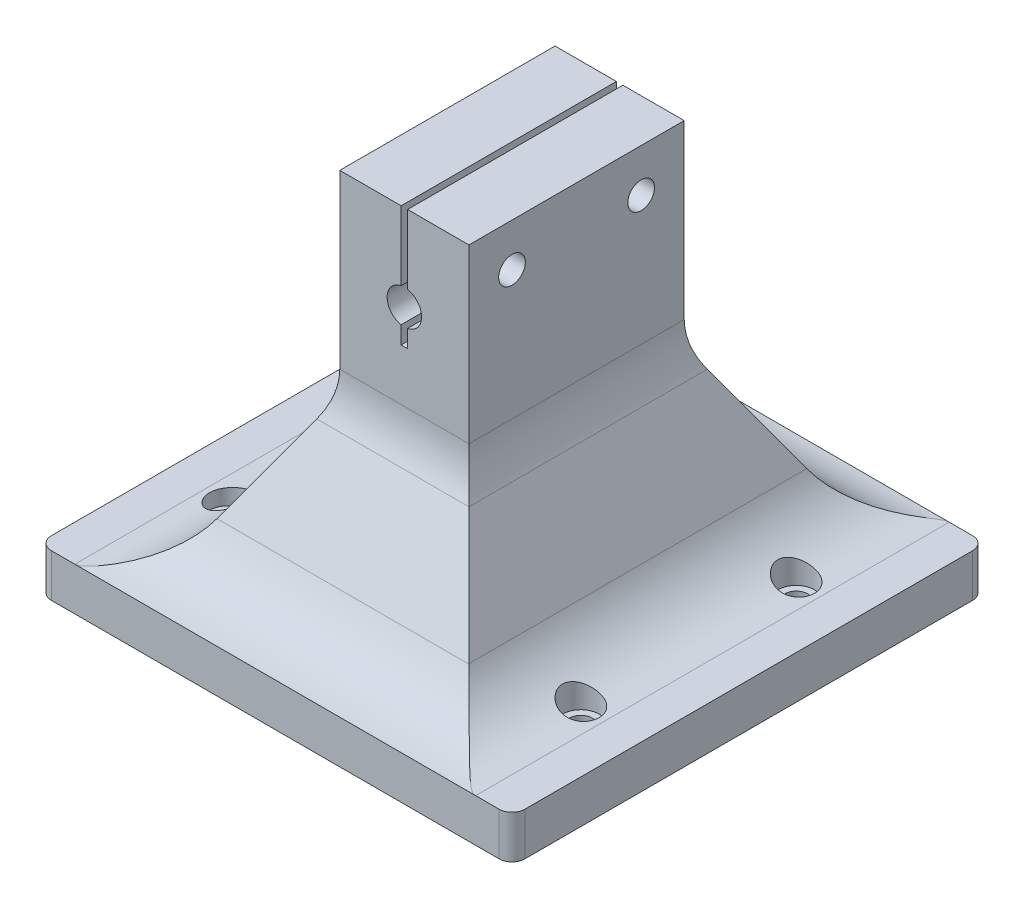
ISO-10303-21;
HEADER;
FILE_DESCRIPTION(('STEP AP214'),'2;1');
FILE_NAME('part.step','',(''),(''),'','','');
FILE_SCHEMA(('AUTOMOTIVE_DESIGN { 1 0 10303 214 1 1 1 1 }'));
ENDSEC;
DATA;
#1=APPLICATION_CONTEXT('core data for automotive mechanical design processes');
#2=APPLICATION_PROTOCOL_DEFINITION('international standard','automotive_design',2000,#1);
#3=PRODUCT_CONTEXT('',#1,'mechanical');
#4=PRODUCT('Part','Part','',(#3));
#5=PRODUCT_RELATED_PRODUCT_CATEGORY('part','',(#4));
#6=PRODUCT_DEFINITION_FORMATION('','',#4);
#7=PRODUCT_DEFINITION_CONTEXT('part definition',#1,'design');
#8=PRODUCT_DEFINITION('design','',#6,#7);
#9=PRODUCT_DEFINITION_SHAPE('','',#8);
#10=(LENGTH_UNIT() NAMED_UNIT(*) SI_UNIT(.MILLI.,.METRE.));
#11=(NAMED_UNIT(*) PLANE_ANGLE_UNIT() SI_UNIT($,.RADIAN.));
#12=(NAMED_UNIT(*) SI_UNIT($,.STERADIAN.) SOLID_ANGLE_UNIT());
#13=UNCERTAINTY_MEASURE_WITH_UNIT(LENGTH_MEASURE(1.E-05),#10,'distance_accuracy_value','');
#14=(GEOMETRIC_REPRESENTATION_CONTEXT(3) GLOBAL_UNCERTAINTY_ASSIGNED_CONTEXT((#13)) GLOBAL_UNIT_ASSIGNED_CONTEXT((#10,
#11,#12)) REPRESENTATION_CONTEXT('',''));
#15=CARTESIAN_POINT('',(0.,0.,0.));
#16=DIRECTION('',(0.,0.,1.));
#17=DIRECTION('',(1.,0.,0.));
#18=AXIS2_PLACEMENT_3D('',#15,#16,#17);
#19=CARTESIAN_POINT('',(0.,10.,0.));
#20=DIRECTION('',(0.,1.,0.));
#21=DIRECTION('',(0.,0.,1.));
#22=AXIS2_PLACEMENT_3D('',#19,#20,#21);
#23=PLANE('',#22);
#24=DIRECTION('',(0.,0.,-1.));
#25=VECTOR('',#24,1.);
#26=CARTESIAN_POINT('',(55.,10.,-55.));
#27=LINE('',#26,#25);
#28=CARTESIAN_POINT('',(55.,10.,52.));
#29=VERTEX_POINT('',#28);
#30=CARTESIAN_POINT('',(55.,10.,-52.));
#31=VERTEX_POINT('',#30);
#32=EDGE_CURVE('E313',#29,#31,#27,.T.);
#33=ORIENTED_EDGE('',*,*,#32,.T.);
#34=CARTESIAN_POINT('',(52.,10.,-52.));
#35=DIRECTION('',(0.,1.,0.));
#36=DIRECTION('',(0.,0.,1.));
#37=AXIS2_PLACEMENT_3D('',#34,#35,#36);
#38=CIRCLE('',#37,3.);
#39=CARTESIAN_POINT('',(52.,10.,-55.));
#40=VERTEX_POINT('',#39);
#41=EDGE_CURVE('E11',#31,#40,#38,.T.);
#42=ORIENTED_EDGE('',*,*,#41,.T.);
#43=DIRECTION('',(-1.,0.,0.));
#44=VECTOR('',#43,1.);
#45=CARTESIAN_POINT('',(-55.,10.,-55.));
#46=LINE('',#45,#44);
#47=CARTESIAN_POINT('',(46.5470053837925,10.,-55.));
#48=VERTEX_POINT('',#47);
#49=EDGE_CURVE('E317',#40,#48,#46,.T.);
#50=ORIENTED_EDGE('',*,*,#49,.T.);
#51=DIRECTION('',(0.,0.,1.));
#52=VECTOR('',#51,1.);
#53=CARTESIAN_POINT('',(46.5470053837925,10.,0.));
#54=LINE('',#53,#52);
#55=CARTESIAN_POINT('',(46.5470053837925,10.,55.));
#56=VERTEX_POINT('',#55);
#57=EDGE_CURVE('E374',#48,#56,#54,.T.);
#58=ORIENTED_EDGE('',*,*,#57,.T.);
#59=DIRECTION('',(1.,0.,0.));
#60=VECTOR('',#59,1.);
#61=CARTESIAN_POINT('',(-55.,10.,55.));
#62=LINE('',#61,#60);
#63=CARTESIAN_POINT('',(52.,10.,55.));
#64=VERTEX_POINT('',#63);
#65=EDGE_CURVE('E323',#56,#64,#62,.T.);
#66=ORIENTED_EDGE('',*,*,#65,.T.);
#67=CARTESIAN_POINT('',(52.,10.,52.));
#68=DIRECTION('',(0.,1.,0.));
#69=DIRECTION('',(0.,0.,1.));
#70=AXIS2_PLACEMENT_3D('',#67,#68,#69);
#71=CIRCLE('',#70,3.);
#72=EDGE_CURVE('E59',#64,#29,#71,.T.);
#73=ORIENTED_EDGE('',*,*,#72,.T.);
#74=EDGE_LOOP('',(#33,#42,#50,#58,#66,#73));
#75=FACE_BOUND('',#74,.T.);
#76=ADVANCED_FACE('F45',(#75),#23,.T.);
#77=CARTESIAN_POINT('',(0.,90.,0.));
#78=DIRECTION('',(0.,1.,0.));
#79=DIRECTION('',(0.,0.,1.));
#80=AXIS2_PLACEMENT_3D('',#77,#78,#79);
#81=PLANE('',#80);
#82=DIRECTION('',(0.,0.,1.));
#83=VECTOR('',#82,1.);
#84=CARTESIAN_POINT('',(-0.749999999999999,90.,-25.));
#85=LINE('',#84,#83);
#86=CARTESIAN_POINT('',(-0.749999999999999,90.,-25.));
#87=VERTEX_POINT('',#86);
#88=CARTESIAN_POINT('',(-0.749999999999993,90.,25.));
#89=VERTEX_POINT('',#88);
#90=EDGE_CURVE('E269',#87,#89,#85,.T.);
#91=ORIENTED_EDGE('',*,*,#90,.F.);
#92=DIRECTION('',(-1.,0.,0.));
#93=VECTOR('',#92,1.);
#94=CARTESIAN_POINT('',(-15.,90.,-25.));
#95=LINE('',#94,#93);
#96=CARTESIAN_POINT('',(-15.,90.,-25.));
#97=VERTEX_POINT('',#96);
#98=EDGE_CURVE('E290',#87,#97,#95,.T.);
#99=ORIENTED_EDGE('',*,*,#98,.T.);
#100=DIRECTION('',(0.,0.,1.));
#101=VECTOR('',#100,1.);
#102=CARTESIAN_POINT('',(-15.,90.,-25.));
#103=LINE('',#102,#101);
#104=CARTESIAN_POINT('',(-15.,90.,25.));
#105=VERTEX_POINT('',#104);
#106=EDGE_CURVE('E295',#97,#105,#103,.T.);
#107=ORIENTED_EDGE('',*,*,#106,.T.);
#108=DIRECTION('',(1.,0.,0.));
#109=VECTOR('',#108,1.);
#110=CARTESIAN_POINT('',(-15.,90.,25.));
#111=LINE('',#110,#109);
#112=EDGE_CURVE('E298',#105,#89,#111,.T.);
#113=ORIENTED_EDGE('',*,*,#112,.T.);
#114=EDGE_LOOP('',(#91,#99,#107,#113));
#115=FACE_BOUND('',#114,.T.);
#116=ADVANCED_FACE('F726',(#115),#81,.T.);
#117=CARTESIAN_POINT('',(0.,70.,55.));
#118=DIRECTION('',(0.,0.,-1.));
#119=DIRECTION('',(-1.,0.,0.));
#120=AXIS2_PLACEMENT_3D('',#117,#118,#119);
#121=CYLINDRICAL_SURFACE('',#120,4.);
#122=CARTESIAN_POINT('',(0.,70.,-25.));
#123=DIRECTION('',(0.,0.,-1.));
#124=DIRECTION('',(-1.,0.,0.));
#125=AXIS2_PLACEMENT_3D('',#122,#123,#124);
#126=CIRCLE('',#125,4.);
#127=CARTESIAN_POINT('',(-0.749999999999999,66.0709415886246,-25.));
#128=VERTEX_POINT('',#127);
#129=CARTESIAN_POINT('',(-0.749999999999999,73.9290584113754,-25.));
#130=VERTEX_POINT('',#129);
#131=EDGE_CURVE('E283',#128,#130,#126,.T.);
#132=ORIENTED_EDGE('',*,*,#131,.T.);
#133=DIRECTION('',(0.,0.,-1.));
#134=VECTOR('',#133,1.);
#135=CARTESIAN_POINT('',(-0.74999999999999,73.9290584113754,55.));
#136=LINE('',#135,#134);
#137=CARTESIAN_POINT('',(-0.74999999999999,73.9290584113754,25.));
#138=VERTEX_POINT('',#137);
#139=EDGE_CURVE('E346',#130,#138,#136,.F.);
#140=ORIENTED_EDGE('',*,*,#139,.T.);
#141=CARTESIAN_POINT('',(0.,70.,25.));
#142=DIRECTION('',(0.,0.,-1.));
#143=DIRECTION('',(-1.,0.,0.));
#144=AXIS2_PLACEMENT_3D('',#141,#142,#143);
#145=CIRCLE('',#144,4.);
#146=CARTESIAN_POINT('',(-0.74999999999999,66.0709415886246,25.));
#147=VERTEX_POINT('',#146);
#148=EDGE_CURVE('E337',#147,#138,#145,.T.);
#149=ORIENTED_EDGE('',*,*,#148,.F.);
#150=DIRECTION('',(0.,0.,-1.));
#151=VECTOR('',#150,1.);
#152=CARTESIAN_POINT('',(-0.74999999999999,66.0709415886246,55.));
#153=LINE('',#152,#151);
#154=EDGE_CURVE('E343',#147,#128,#153,.T.);
#155=ORIENTED_EDGE('',*,*,#154,.T.);
#156=EDGE_LOOP('',(#132,#140,#149,#155));
#157=FACE_BOUND('',#156,.T.);
#158=ADVANCED_FACE('F723',(#157),#121,.F.);
#159=CARTESIAN_POINT('',(55.,10.,-55.));
#160=DIRECTION('',(-1.,0.,0.));
#161=DIRECTION('',(0.,0.,1.));
#162=AXIS2_PLACEMENT_3D('',#159,#160,#161);
#163=PLANE('',#162);
#164=DIRECTION('',(0.,0.,-1.));
#165=VECTOR('',#164,1.);
#166=CARTESIAN_POINT('',(55.,0.,-55.));
#167=LINE('',#166,#165);
#168=CARTESIAN_POINT('',(55.,0.,52.));
#169=VERTEX_POINT('',#168);
#170=CARTESIAN_POINT('',(55.,0.,-52.));
#171=VERTEX_POINT('',#170);
#172=EDGE_CURVE('E312',#169,#171,#167,.T.);
#173=ORIENTED_EDGE('',*,*,#172,.T.);
#174=DIRECTION('',(0.,-1.,0.));
#175=VECTOR('',#174,1.);
#176=CARTESIAN_POINT('',(55.,10.,-52.));
#177=LINE('',#176,#175);
#178=EDGE_CURVE('E67',#171,#31,#177,.F.);
#179=ORIENTED_EDGE('',*,*,#178,.T.);
#180=ORIENTED_EDGE('',*,*,#32,.F.);
#181=DIRECTION('',(0.,-1.,0.));
#182=VECTOR('',#181,1.);
#183=CARTESIAN_POINT('',(55.,10.,52.));
#184=LINE('',#183,#182);
#185=EDGE_CURVE('E561',#29,#169,#184,.T.);
#186=ORIENTED_EDGE('',*,*,#185,.T.);
#187=EDGE_LOOP('',(#173,#179,#180,#186));
#188=FACE_BOUND('',#187,.T.);
#189=ADVANCED_FACE('F710',(#188),#163,.F.);
#190=CARTESIAN_POINT('',(-55.,10.,-55.));
#191=DIRECTION('',(0.,0.,1.));
#192=DIRECTION('',(1.,0.,0.));
#193=AXIS2_PLACEMENT_3D('',#190,#191,#192);
#194=PLANE('',#193);
#195=DIRECTION('',(-1.,0.,0.));
#196=VECTOR('',#195,1.);
#197=CARTESIAN_POINT('',(-55.,0.,-55.));
#198=LINE('',#197,#196);
#199=CARTESIAN_POINT('',(52.,0.,-55.));
#200=VERTEX_POINT('',#199);
#201=CARTESIAN_POINT('',(-52.,0.,-55.));
#202=VERTEX_POINT('',#201);
#203=EDGE_CURVE('E329',#200,#202,#198,.T.);
#204=ORIENTED_EDGE('',*,*,#203,.T.);
#205=DIRECTION('',(0.,-1.,0.));
#206=VECTOR('',#205,1.);
#207=CARTESIAN_POINT('',(-52.,10.,-55.));
#208=LINE('',#207,#206);
#209=CARTESIAN_POINT('',(-52.,10.,-55.));
#210=VERTEX_POINT('',#209);
#211=EDGE_CURVE('E559',#202,#210,#208,.F.);
#212=ORIENTED_EDGE('',*,*,#211,.T.);
#213=CARTESIAN_POINT('',(-46.5470053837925,10.,-55.));
#214=VERTEX_POINT('',#213);
#215=EDGE_CURVE('E315',#214,#210,#46,.T.);
#216=ORIENTED_EDGE('',*,*,#215,.F.);
#217=EDGE_CURVE('E320',#48,#214,#46,.T.);
#218=ORIENTED_EDGE('',*,*,#217,.F.);
#219=ORIENTED_EDGE('',*,*,#49,.F.);
#220=DIRECTION('',(0.,-1.,0.));
#221=VECTOR('',#220,1.);
#222=CARTESIAN_POINT('',(52.,10.,-55.));
#223=LINE('',#222,#221);
#224=EDGE_CURVE('E556',#40,#200,#223,.T.);
#225=ORIENTED_EDGE('',*,*,#224,.T.);
#226=EDGE_LOOP('',(#204,#212,#216,#218,#219,#225));
#227=FACE_BOUND('',#226,.T.);
#228=ADVANCED_FACE('F715',(#227),#194,.F.);
#229=CARTESIAN_POINT('',(-55.,10.,-55.));
#230=DIRECTION('',(1.,0.,0.));
#231=DIRECTION('',(0.,0.,-1.));
#232=AXIS2_PLACEMENT_3D('',#229,#230,#231);
#233=PLANE('',#232);
#234=DIRECTION('',(0.,0.,1.));
#235=VECTOR('',#234,1.);
#236=CARTESIAN_POINT('',(-55.,0.,-55.));
#237=LINE('',#236,#235);
#238=CARTESIAN_POINT('',(-55.,0.,-52.));
#239=VERTEX_POINT('',#238);
#240=CARTESIAN_POINT('',(-55.,0.,52.));
#241=VERTEX_POINT('',#240);
#242=EDGE_CURVE('E332',#239,#241,#237,.T.);
#243=ORIENTED_EDGE('',*,*,#242,.T.);
#244=DIRECTION('',(0.,-1.,0.));
#245=VECTOR('',#244,1.);
#246=CARTESIAN_POINT('',(-55.,10.,52.));
#247=LINE('',#246,#245);
#248=CARTESIAN_POINT('',(-55.,10.,52.));
#249=VERTEX_POINT('',#248);
#250=EDGE_CURVE('E550',#241,#249,#247,.F.);
#251=ORIENTED_EDGE('',*,*,#250,.T.);
#252=DIRECTION('',(0.,0.,1.));
#253=VECTOR('',#252,1.);
#254=CARTESIAN_POINT('',(-55.,10.,-55.));
#255=LINE('',#254,#253);
#256=CARTESIAN_POINT('',(-55.,10.,-52.));
#257=VERTEX_POINT('',#256);
#258=EDGE_CURVE('E319',#257,#249,#255,.T.);
#259=ORIENTED_EDGE('',*,*,#258,.F.);
#260=DIRECTION('',(0.,-1.,0.));
#261=VECTOR('',#260,1.);
#262=CARTESIAN_POINT('',(-55.,10.,-52.));
#263=LINE('',#262,#261);
#264=EDGE_CURVE('E547',#257,#239,#263,.T.);
#265=ORIENTED_EDGE('',*,*,#264,.T.);
#266=EDGE_LOOP('',(#243,#251,#259,#265));
#267=FACE_BOUND('',#266,.T.);
#268=ADVANCED_FACE('F691',(#267),#233,.F.);
#269=CARTESIAN_POINT('',(-55.,10.,55.));
#270=DIRECTION('',(0.,0.,-1.));
#271=DIRECTION('',(-1.,0.,0.));
#272=AXIS2_PLACEMENT_3D('',#269,#270,#271);
#273=PLANE('',#272);
#274=CARTESIAN_POINT('',(-52.,10.,55.));
#275=VERTEX_POINT('',#274);
#276=CARTESIAN_POINT('',(-46.5470053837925,10.,55.));
#277=VERTEX_POINT('',#276);
#278=EDGE_CURVE('E324',#275,#277,#62,.T.);
#279=ORIENTED_EDGE('',*,*,#278,.F.);
#280=DIRECTION('',(0.,-1.,0.));
#281=VECTOR('',#280,1.);
#282=CARTESIAN_POINT('',(-52.,10.,55.));
#283=LINE('',#282,#281);
#284=CARTESIAN_POINT('',(-52.,0.,55.));
#285=VERTEX_POINT('',#284);
#286=EDGE_CURVE('E536',#275,#285,#283,.T.);
#287=ORIENTED_EDGE('',*,*,#286,.T.);
#288=DIRECTION('',(1.,0.,0.));
#289=VECTOR('',#288,1.);
#290=CARTESIAN_POINT('',(-55.,0.,55.));
#291=LINE('',#290,#289);
#292=CARTESIAN_POINT('',(52.,0.,55.));
#293=VERTEX_POINT('',#292);
#294=EDGE_CURVE('E316',#285,#293,#291,.T.);
#295=ORIENTED_EDGE('',*,*,#294,.T.);
#296=DIRECTION('',(0.,-1.,0.));
#297=VECTOR('',#296,1.);
#298=CARTESIAN_POINT('',(52.,10.,55.));
#299=LINE('',#298,#297);
#300=EDGE_CURVE('E524',#293,#64,#299,.F.);
#301=ORIENTED_EDGE('',*,*,#300,.T.);
#302=ORIENTED_EDGE('',*,*,#65,.F.);
#303=EDGE_CURVE('E327',#277,#56,#62,.T.);
#304=ORIENTED_EDGE('',*,*,#303,.F.);
#305=EDGE_LOOP('',(#279,#287,#295,#301,#302,#304));
#306=FACE_BOUND('',#305,.T.);
#307=ADVANCED_FACE('F703',(#306),#273,.F.);
#308=ORIENTED_EDGE('',*,*,#258,.T.);
#309=CARTESIAN_POINT('',(-52.,10.,52.));
#310=DIRECTION('',(0.,1.,0.));
#311=DIRECTION('',(0.,0.,1.));
#312=AXIS2_PLACEMENT_3D('',#309,#310,#311);
#313=CIRCLE('',#312,3.);
#314=EDGE_CURVE('E554',#249,#275,#313,.T.);
#315=ORIENTED_EDGE('',*,*,#314,.T.);
#316=ORIENTED_EDGE('',*,*,#278,.T.);
#317=DIRECTION('',(0.,0.,-1.));
#318=VECTOR('',#317,1.);
#319=CARTESIAN_POINT('',(-46.5470053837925,10.,0.));
#320=LINE('',#319,#318);
#321=EDGE_CURVE('E350',#277,#214,#320,.T.);
#322=ORIENTED_EDGE('',*,*,#321,.T.);
#323=ORIENTED_EDGE('',*,*,#215,.T.);
#324=CARTESIAN_POINT('',(-52.,10.,-52.));
#325=DIRECTION('',(0.,1.,0.));
#326=DIRECTION('',(0.,0.,1.));
#327=AXIS2_PLACEMENT_3D('',#324,#325,#326);
#328=CIRCLE('',#327,3.);
#329=EDGE_CURVE('E552',#210,#257,#328,.T.);
#330=ORIENTED_EDGE('',*,*,#329,.T.);
#331=EDGE_LOOP('',(#308,#315,#316,#322,#323,#330));
#332=FACE_BOUND('',#331,.T.);
#333=ADVANCED_FACE('F683',(#332),#23,.T.);
#334=CARTESIAN_POINT('',(0.,0.,0.));
#335=DIRECTION('',(0.,1.,0.));
#336=DIRECTION('',(0.,0.,1.));
#337=AXIS2_PLACEMENT_3D('',#334,#335,#336);
#338=PLANE('',#337);
#339=CARTESIAN_POINT('',(41.,0.,-25.));
#340=DIRECTION('',(0.,-1.,0.));
#341=DIRECTION('',(0.,0.,1.));
#342=AXIS2_PLACEMENT_3D('',#339,#340,#341);
#343=CIRCLE('',#342,2.65);
#344=CARTESIAN_POINT('',(41.,0.,-27.65));
#345=VERTEX_POINT('',#344);
#346=EDGE_CURVE('E595',#345,#345,#343,.T.);
#347=ORIENTED_EDGE('',*,*,#346,.F.);
#348=EDGE_LOOP('',(#347));
#349=FACE_BOUND('',#348,.T.);
#350=CARTESIAN_POINT('',(-41.,0.,-25.));
#351=DIRECTION('',(0.,-1.,0.));
#352=DIRECTION('',(0.,0.,-1.));
#353=AXIS2_PLACEMENT_3D('',#350,#351,#352);
#354=CIRCLE('',#353,2.65);
#355=CARTESIAN_POINT('',(-41.,0.,-27.65));
#356=VERTEX_POINT('',#355);
#357=EDGE_CURVE('E591',#356,#356,#354,.T.);
#358=ORIENTED_EDGE('',*,*,#357,.F.);
#359=EDGE_LOOP('',(#358));
#360=FACE_BOUND('',#359,.T.);
#361=CARTESIAN_POINT('',(-41.,0.,25.));
#362=DIRECTION('',(0.,-1.,0.));
#363=DIRECTION('',(0.,0.,1.));
#364=AXIS2_PLACEMENT_3D('',#361,#362,#363);
#365=CIRCLE('',#364,2.65);
#366=CARTESIAN_POINT('',(-41.,0.,22.35));
#367=VERTEX_POINT('',#366);
#368=EDGE_CURVE('E588',#367,#367,#365,.T.);
#369=ORIENTED_EDGE('',*,*,#368,.F.);
#370=EDGE_LOOP('',(#369));
#371=FACE_BOUND('',#370,.T.);
#372=CARTESIAN_POINT('',(41.,0.,25.));
#373=DIRECTION('',(0.,-1.,0.));
#374=DIRECTION('',(0.,0.,-1.));
#375=AXIS2_PLACEMENT_3D('',#372,#373,#374);
#376=CIRCLE('',#375,2.65);
#377=CARTESIAN_POINT('',(41.,0.,22.35));
#378=VERTEX_POINT('',#377);
#379=EDGE_CURVE('E528',#378,#378,#376,.T.);
#380=ORIENTED_EDGE('',*,*,#379,.F.);
#381=EDGE_LOOP('',(#380));
#382=FACE_BOUND('',#381,.T.);
#383=ORIENTED_EDGE('',*,*,#294,.F.);
#384=CARTESIAN_POINT('',(-52.,0.,52.));
#385=DIRECTION('',(0.,1.,0.));
#386=DIRECTION('',(0.,0.,1.));
#387=AXIS2_PLACEMENT_3D('',#384,#385,#386);
#388=CIRCLE('',#387,3.);
#389=EDGE_CURVE('E545',#285,#241,#388,.F.);
#390=ORIENTED_EDGE('',*,*,#389,.T.);
#391=ORIENTED_EDGE('',*,*,#242,.F.);
#392=CARTESIAN_POINT('',(-52.,0.,-52.));
#393=DIRECTION('',(0.,1.,0.));
#394=DIRECTION('',(0.,0.,1.));
#395=AXIS2_PLACEMENT_3D('',#392,#393,#394);
#396=CIRCLE('',#395,3.);
#397=EDGE_CURVE('E543',#239,#202,#396,.F.);
#398=ORIENTED_EDGE('',*,*,#397,.T.);
#399=ORIENTED_EDGE('',*,*,#203,.F.);
#400=CARTESIAN_POINT('',(52.,0.,-52.));
#401=DIRECTION('',(0.,1.,0.));
#402=DIRECTION('',(0.,0.,1.));
#403=AXIS2_PLACEMENT_3D('',#400,#401,#402);
#404=CIRCLE('',#403,3.);
#405=EDGE_CURVE('E541',#200,#171,#404,.F.);
#406=ORIENTED_EDGE('',*,*,#405,.T.);
#407=ORIENTED_EDGE('',*,*,#172,.F.);
#408=CARTESIAN_POINT('',(52.,0.,52.));
#409=DIRECTION('',(0.,1.,0.));
#410=DIRECTION('',(0.,0.,1.));
#411=AXIS2_PLACEMENT_3D('',#408,#409,#410);
#412=CIRCLE('',#411,3.);
#413=EDGE_CURVE('E539',#169,#293,#412,.F.);
#414=ORIENTED_EDGE('',*,*,#413,.T.);
#415=EDGE_LOOP('',(#383,#390,#391,#398,#399,#406,#407,#414));
#416=FACE_BOUND('',#415,.T.);
#417=ADVANCED_FACE('F695',(#349,#360,#371,#382,#416),#338,.F.);
#418=CARTESIAN_POINT('',(15.,90.,-25.));
#419=DIRECTION('',(-1.,0.,0.));
#420=DIRECTION('',(0.,0.,1.));
#421=AXIS2_PLACEMENT_3D('',#418,#419,#420);
#422=PLANE('',#421);
#423=CARTESIAN_POINT('',(15.,80.,-15.));
#424=DIRECTION('',(-1.,0.,0.));
#425=DIRECTION('',(0.,0.,1.));
#426=AXIS2_PLACEMENT_3D('',#423,#424,#425);
#427=CIRCLE('',#426,3.10000000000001);
#428=CARTESIAN_POINT('',(15.,80.,-11.9));
#429=VERTEX_POINT('',#428);
#430=EDGE_CURVE('E272',#429,#429,#427,.T.);
#431=ORIENTED_EDGE('',*,*,#430,.T.);
#432=EDGE_LOOP('',(#431));
#433=FACE_BOUND('',#432,.T.);
#434=CARTESIAN_POINT('',(15.,80.,15.));
#435=DIRECTION('',(-1.,0.,0.));
#436=DIRECTION('',(0.,0.,1.));
#437=AXIS2_PLACEMENT_3D('',#434,#435,#436);
#438=CIRCLE('',#437,3.1);
#439=CARTESIAN_POINT('',(15.,80.,18.1));
#440=VERTEX_POINT('',#439);
#441=EDGE_CURVE('E360',#440,#440,#438,.T.);
#442=ORIENTED_EDGE('',*,*,#441,.T.);
#443=EDGE_LOOP('',(#442));
#444=FACE_BOUND('',#443,.T.);
#445=DIRECTION('',(0.,-1.,0.));
#446=VECTOR('',#445,1.);
#447=CARTESIAN_POINT('',(15.,90.,25.));
#448=LINE('',#447,#446);
#449=CARTESIAN_POINT('',(15.,90.,25.));
#450=VERTEX_POINT('',#449);
#451=CARTESIAN_POINT('',(15.,50.0000000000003,25.));
#452=VERTEX_POINT('',#451);
#453=EDGE_CURVE('E301',#450,#452,#448,.T.);
#454=ORIENTED_EDGE('',*,*,#453,.T.);
#455=DIRECTION('',(0.,0.,-1.));
#456=VECTOR('',#455,1.);
#457=CARTESIAN_POINT('',(15.,50.0000000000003,-25.));
#458=LINE('',#457,#456);
#459=CARTESIAN_POINT('',(15.,50.0000000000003,-25.));
#460=VERTEX_POINT('',#459);
#461=EDGE_CURVE('E512',#452,#460,#458,.T.);
#462=ORIENTED_EDGE('',*,*,#461,.T.);
#463=DIRECTION('',(0.,-1.,0.));
#464=VECTOR('',#463,1.);
#465=CARTESIAN_POINT('',(15.,90.,-25.));
#466=LINE('',#465,#464);
#467=CARTESIAN_POINT('',(15.,90.,-25.));
#468=VERTEX_POINT('',#467);
#469=EDGE_CURVE('E310',#468,#460,#466,.T.);
#470=ORIENTED_EDGE('',*,*,#469,.F.);
#471=DIRECTION('',(0.,0.,-1.));
#472=VECTOR('',#471,1.);
#473=CARTESIAN_POINT('',(15.,90.,-25.));
#474=LINE('',#473,#472);
#475=EDGE_CURVE('E287',#450,#468,#474,.T.);
#476=ORIENTED_EDGE('',*,*,#475,.F.);
#477=EDGE_LOOP('',(#454,#462,#470,#476));
#478=FACE_BOUND('',#477,.T.);
#479=ADVANCED_FACE('F625',(#433,#444,#478),#422,.F.);
#480=CARTESIAN_POINT('',(-15.,90.,-25.));
#481=DIRECTION('',(0.,0.,1.));
#482=DIRECTION('',(1.,0.,0.));
#483=AXIS2_PLACEMENT_3D('',#480,#481,#482);
#484=PLANE('',#483);
#485=ORIENTED_EDGE('',*,*,#469,.T.);
#486=DIRECTION('',(-1.,0.,0.));
#487=VECTOR('',#486,1.);
#488=CARTESIAN_POINT('',(-15.,50.0000000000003,-25.));
#489=LINE('',#488,#487);
#490=CARTESIAN_POINT('',(-15.,50.0000000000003,-25.));
#491=VERTEX_POINT('',#490);
#492=EDGE_CURVE('E516',#460,#491,#489,.T.);
#493=ORIENTED_EDGE('',*,*,#492,.T.);
#494=DIRECTION('',(0.,-1.,0.));
#495=VECTOR('',#494,1.);
#496=CARTESIAN_POINT('',(-15.,90.,-25.));
#497=LINE('',#496,#495);
#498=EDGE_CURVE('E307',#97,#491,#497,.T.);
#499=ORIENTED_EDGE('',*,*,#498,.F.);
#500=ORIENTED_EDGE('',*,*,#98,.F.);
#501=DIRECTION('',(0.,1.,0.));
#502=VECTOR('',#501,1.);
#503=CARTESIAN_POINT('',(-0.749999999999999,62.,-25.));
#504=LINE('',#503,#502);
#505=EDGE_CURVE('E258',#130,#87,#504,.T.);
#506=ORIENTED_EDGE('',*,*,#505,.F.);
#507=ORIENTED_EDGE('',*,*,#131,.F.);
#508=CARTESIAN_POINT('',(-0.749999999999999,62.,-25.));
#509=VERTEX_POINT('',#508);
#510=EDGE_CURVE('E264',#509,#128,#504,.T.);
#511=ORIENTED_EDGE('',*,*,#510,.F.);
#512=DIRECTION('',(-1.,0.,0.));
#513=VECTOR('',#512,1.);
#514=CARTESIAN_POINT('',(-0.749999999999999,62.,-25.));
#515=LINE('',#514,#513);
#516=CARTESIAN_POINT('',(0.750000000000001,62.,-25.));
#517=VERTEX_POINT('',#516);
#518=EDGE_CURVE('E242',#517,#509,#515,.T.);
#519=ORIENTED_EDGE('',*,*,#518,.F.);
#520=DIRECTION('',(0.,1.,0.));
#521=VECTOR('',#520,1.);
#522=CARTESIAN_POINT('',(0.750000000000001,62.,-25.));
#523=LINE('',#522,#521);
#524=CARTESIAN_POINT('',(0.750000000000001,66.0709415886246,-25.));
#525=VERTEX_POINT('',#524);
#526=EDGE_CURVE('E251',#517,#525,#523,.T.);
#527=ORIENTED_EDGE('',*,*,#526,.T.);
#528=CARTESIAN_POINT('',(0.750000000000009,73.9290584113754,-25.));
#529=VERTEX_POINT('',#528);
#530=EDGE_CURVE('E286',#529,#525,#126,.T.);
#531=ORIENTED_EDGE('',*,*,#530,.F.);
#532=CARTESIAN_POINT('',(0.750000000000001,90.,-25.));
#533=VERTEX_POINT('',#532);
#534=EDGE_CURVE('E259',#529,#533,#523,.T.);
#535=ORIENTED_EDGE('',*,*,#534,.T.);
#536=EDGE_CURVE('E292',#468,#533,#95,.T.);
#537=ORIENTED_EDGE('',*,*,#536,.F.);
#538=EDGE_LOOP('',(#485,#493,#499,#500,#506,#507,#511,#519,#527,#531,#535,#537));
#539=FACE_BOUND('',#538,.T.);
#540=ADVANCED_FACE('F262',(#539),#484,.F.);
#541=CARTESIAN_POINT('',(-15.,90.,-25.));
#542=DIRECTION('',(1.,0.,0.));
#543=DIRECTION('',(0.,0.,-1.));
#544=AXIS2_PLACEMENT_3D('',#541,#542,#543);
#545=PLANE('',#544);
#546=CARTESIAN_POINT('',(-15.,80.,-15.));
#547=DIRECTION('',(-1.,0.,0.));
#548=DIRECTION('',(0.,0.,1.));
#549=AXIS2_PLACEMENT_3D('',#546,#547,#548);
#550=CIRCLE('',#549,3.10000000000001);
#551=CARTESIAN_POINT('',(-15.,80.,-11.9));
#552=VERTEX_POINT('',#551);
#553=EDGE_CURVE('E355',#552,#552,#550,.T.);
#554=ORIENTED_EDGE('',*,*,#553,.F.);
#555=EDGE_LOOP('',(#554));
#556=FACE_BOUND('',#555,.T.);
#557=CARTESIAN_POINT('',(-15.,80.,15.));
#558=DIRECTION('',(-1.,0.,0.));
#559=DIRECTION('',(0.,0.,1.));
#560=AXIS2_PLACEMENT_3D('',#557,#558,#559);
#561=CIRCLE('',#560,3.1);
#562=CARTESIAN_POINT('',(-15.,80.,18.1));
#563=VERTEX_POINT('',#562);
#564=EDGE_CURVE('E372',#563,#563,#561,.T.);
#565=ORIENTED_EDGE('',*,*,#564,.F.);
#566=EDGE_LOOP('',(#565));
#567=FACE_BOUND('',#566,.T.);
#568=ORIENTED_EDGE('',*,*,#498,.T.);
#569=DIRECTION('',(0.,0.,1.));
#570=VECTOR('',#569,1.);
#571=CARTESIAN_POINT('',(-15.,50.0000000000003,25.));
#572=LINE('',#571,#570);
#573=CARTESIAN_POINT('',(-15.,50.0000000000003,25.));
#574=VERTEX_POINT('',#573);
#575=EDGE_CURVE('E520',#491,#574,#572,.T.);
#576=ORIENTED_EDGE('',*,*,#575,.T.);
#577=DIRECTION('',(0.,-1.,0.));
#578=VECTOR('',#577,1.);
#579=CARTESIAN_POINT('',(-15.,90.,25.));
#580=LINE('',#579,#578);
#581=EDGE_CURVE('E304',#105,#574,#580,.T.);
#582=ORIENTED_EDGE('',*,*,#581,.F.);
#583=ORIENTED_EDGE('',*,*,#106,.F.);
#584=EDGE_LOOP('',(#568,#576,#582,#583));
#585=FACE_BOUND('',#584,.T.);
#586=ADVANCED_FACE('F786',(#556,#567,#585),#545,.F.);
#587=CARTESIAN_POINT('',(-15.,90.,25.));
#588=DIRECTION('',(0.,0.,-1.));
#589=DIRECTION('',(-1.,0.,0.));
#590=AXIS2_PLACEMENT_3D('',#587,#588,#589);
#591=PLANE('',#590);
#592=ORIENTED_EDGE('',*,*,#581,.T.);
#593=DIRECTION('',(1.,0.,0.));
#594=VECTOR('',#593,1.);
#595=CARTESIAN_POINT('',(15.,50.0000000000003,25.));
#596=LINE('',#595,#594);
#597=EDGE_CURVE('E397',#574,#452,#596,.T.);
#598=ORIENTED_EDGE('',*,*,#597,.T.);
#599=ORIENTED_EDGE('',*,*,#453,.F.);
#600=CARTESIAN_POINT('',(0.750000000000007,90.,25.));
#601=VERTEX_POINT('',#600);
#602=EDGE_CURVE('E297',#601,#450,#111,.T.);
#603=ORIENTED_EDGE('',*,*,#602,.F.);
#604=DIRECTION('',(0.,-1.,0.));
#605=VECTOR('',#604,1.);
#606=CARTESIAN_POINT('',(0.750000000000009,90.,25.));
#607=LINE('',#606,#605);
#608=CARTESIAN_POINT('',(0.75000000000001,73.9290584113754,25.));
#609=VERTEX_POINT('',#608);
#610=EDGE_CURVE('E274',#601,#609,#607,.T.);
#611=ORIENTED_EDGE('',*,*,#610,.T.);
#612=CARTESIAN_POINT('',(0.750000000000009,66.0709415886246,25.));
#613=VERTEX_POINT('',#612);
#614=EDGE_CURVE('E291',#609,#613,#145,.T.);
#615=ORIENTED_EDGE('',*,*,#614,.T.);
#616=CARTESIAN_POINT('',(0.750000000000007,62.,25.));
#617=VERTEX_POINT('',#616);
#618=EDGE_CURVE('E278',#613,#617,#607,.T.);
#619=ORIENTED_EDGE('',*,*,#618,.T.);
#620=DIRECTION('',(1.,0.,0.));
#621=VECTOR('',#620,1.);
#622=CARTESIAN_POINT('',(-15.,62.,25.));
#623=LINE('',#622,#621);
#624=CARTESIAN_POINT('',(-0.749999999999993,62.,25.));
#625=VERTEX_POINT('',#624);
#626=EDGE_CURVE('E245',#625,#617,#623,.T.);
#627=ORIENTED_EDGE('',*,*,#626,.F.);
#628=DIRECTION('',(0.,1.,0.));
#629=VECTOR('',#628,1.);
#630=CARTESIAN_POINT('',(-0.749999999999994,90.,25.));
#631=LINE('',#630,#629);
#632=EDGE_CURVE('E279',#625,#147,#631,.T.);
#633=ORIENTED_EDGE('',*,*,#632,.T.);
#634=ORIENTED_EDGE('',*,*,#148,.T.);
#635=EDGE_CURVE('E282',#138,#89,#631,.T.);
#636=ORIENTED_EDGE('',*,*,#635,.T.);
#637=ORIENTED_EDGE('',*,*,#112,.F.);
#638=EDGE_LOOP('',(#592,#598,#599,#603,#611,#615,#619,#627,#633,#634,#636,#637));
#639=FACE_BOUND('',#638,.T.);
#640=ADVANCED_FACE('F610',(#639),#591,.F.);
#641=DIRECTION('',(0.,0.,-1.));
#642=VECTOR('',#641,1.);
#643=CARTESIAN_POINT('',(0.750000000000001,90.,-25.));
#644=LINE('',#643,#642);
#645=EDGE_CURVE('E271',#601,#533,#644,.T.);
#646=ORIENTED_EDGE('',*,*,#645,.F.);
#647=ORIENTED_EDGE('',*,*,#602,.T.);
#648=ORIENTED_EDGE('',*,*,#475,.T.);
#649=ORIENTED_EDGE('',*,*,#536,.T.);
#650=EDGE_LOOP('',(#646,#647,#648,#649));
#651=FACE_BOUND('',#650,.T.);
#652=ADVANCED_FACE('F619',(#651),#81,.T.);
#653=ORIENTED_EDGE('',*,*,#530,.T.);
#654=DIRECTION('',(0.,0.,-1.));
#655=VECTOR('',#654,1.);
#656=CARTESIAN_POINT('',(0.75000000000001,66.0709415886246,55.));
#657=LINE('',#656,#655);
#658=EDGE_CURVE('E254',#525,#613,#657,.F.);
#659=ORIENTED_EDGE('',*,*,#658,.T.);
#660=ORIENTED_EDGE('',*,*,#614,.F.);
#661=DIRECTION('',(0.,0.,-1.));
#662=VECTOR('',#661,1.);
#663=CARTESIAN_POINT('',(0.75000000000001,73.9290584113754,55.));
#664=LINE('',#663,#662);
#665=EDGE_CURVE('E326',#609,#529,#664,.T.);
#666=ORIENTED_EDGE('',*,*,#665,.T.);
#667=EDGE_LOOP('',(#653,#659,#660,#666));
#668=FACE_BOUND('',#667,.T.);
#669=ADVANCED_FACE('F615',(#668),#121,.F.);
#670=CARTESIAN_POINT('',(0.750000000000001,62.,-25.));
#671=DIRECTION('',(1.,0.,0.));
#672=DIRECTION('',(0.,0.,-1.));
#673=AXIS2_PLACEMENT_3D('',#670,#671,#672);
#674=PLANE('',#673);
#675=CARTESIAN_POINT('',(0.750000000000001,80.,-15.));
#676=DIRECTION('',(1.,0.,0.));
#677=DIRECTION('',(0.,0.,-1.));
#678=AXIS2_PLACEMENT_3D('',#675,#676,#677);
#679=CIRCLE('',#678,3.10000000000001);
#680=CARTESIAN_POINT('',(0.75,80.,-18.1));
#681=VERTEX_POINT('',#680);
#682=EDGE_CURVE('E359',#681,#681,#679,.T.);
#683=ORIENTED_EDGE('',*,*,#682,.T.);
#684=EDGE_LOOP('',(#683));
#685=FACE_BOUND('',#684,.T.);
#686=CARTESIAN_POINT('',(0.750000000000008,80.,15.));
#687=DIRECTION('',(1.,0.,0.));
#688=DIRECTION('',(0.,0.,-1.));
#689=AXIS2_PLACEMENT_3D('',#686,#687,#688);
#690=CIRCLE('',#689,3.1);
#691=CARTESIAN_POINT('',(0.750000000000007,80.,11.9));
#692=VERTEX_POINT('',#691);
#693=EDGE_CURVE('E354',#692,#692,#690,.T.);
#694=ORIENTED_EDGE('',*,*,#693,.T.);
#695=EDGE_LOOP('',(#694));
#696=FACE_BOUND('',#695,.T.);
#697=ORIENTED_EDGE('',*,*,#645,.T.);
#698=ORIENTED_EDGE('',*,*,#534,.F.);
#699=ORIENTED_EDGE('',*,*,#665,.F.);
#700=ORIENTED_EDGE('',*,*,#610,.F.);
#701=EDGE_LOOP('',(#697,#698,#699,#700));
#702=FACE_BOUND('',#701,.T.);
#703=ADVANCED_FACE('F815',(#685,#696,#702),#674,.F.);
#704=ORIENTED_EDGE('',*,*,#658,.F.);
#705=ORIENTED_EDGE('',*,*,#526,.F.);
#706=DIRECTION('',(0.,0.,-1.));
#707=VECTOR('',#706,1.);
#708=CARTESIAN_POINT('',(0.750000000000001,62.,-25.));
#709=LINE('',#708,#707);
#710=EDGE_CURVE('E237',#617,#517,#709,.T.);
#711=ORIENTED_EDGE('',*,*,#710,.F.);
#712=ORIENTED_EDGE('',*,*,#618,.F.);
#713=EDGE_LOOP('',(#704,#705,#711,#712));
#714=FACE_BOUND('',#713,.T.);
#715=ADVANCED_FACE('F252',(#714),#674,.F.);
#716=CARTESIAN_POINT('',(-0.749999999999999,62.,-25.));
#717=DIRECTION('',(-1.,0.,0.));
#718=DIRECTION('',(0.,0.,1.));
#719=AXIS2_PLACEMENT_3D('',#716,#717,#718);
#720=PLANE('',#719);
#721=DIRECTION('',(0.,0.,1.));
#722=VECTOR('',#721,1.);
#723=CARTESIAN_POINT('',(-0.749999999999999,62.,-25.));
#724=LINE('',#723,#722);
#725=EDGE_CURVE('E248',#509,#625,#724,.T.);
#726=ORIENTED_EDGE('',*,*,#725,.F.);
#727=ORIENTED_EDGE('',*,*,#510,.T.);
#728=ORIENTED_EDGE('',*,*,#154,.F.);
#729=ORIENTED_EDGE('',*,*,#632,.F.);
#730=EDGE_LOOP('',(#726,#727,#728,#729));
#731=FACE_BOUND('',#730,.T.);
#732=ADVANCED_FACE('F845',(#731),#720,.F.);
#733=CARTESIAN_POINT('',(0.,62.,0.));
#734=DIRECTION('',(0.,1.,0.));
#735=DIRECTION('',(0.,0.,1.));
#736=AXIS2_PLACEMENT_3D('',#733,#734,#735);
#737=PLANE('',#736);
#738=ORIENTED_EDGE('',*,*,#626,.T.);
#739=ORIENTED_EDGE('',*,*,#710,.T.);
#740=ORIENTED_EDGE('',*,*,#518,.T.);
#741=ORIENTED_EDGE('',*,*,#725,.T.);
#742=EDGE_LOOP('',(#738,#739,#740,#741));
#743=FACE_BOUND('',#742,.T.);
#744=ADVANCED_FACE('F239',(#743),#737,.T.);
#745=CARTESIAN_POINT('',(-0.750000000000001,80.,-15.));
#746=DIRECTION('',(-1.,0.,0.));
#747=DIRECTION('',(0.,0.,1.));
#748=AXIS2_PLACEMENT_3D('',#745,#746,#747);
#749=CIRCLE('',#748,3.10000000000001);
#750=CARTESIAN_POINT('',(-0.75,80.,-11.9));
#751=VERTEX_POINT('',#750);
#752=EDGE_CURVE('E356',#751,#751,#749,.T.);
#753=ORIENTED_EDGE('',*,*,#752,.T.);
#754=EDGE_LOOP('',(#753));
#755=FACE_BOUND('',#754,.T.);
#756=CARTESIAN_POINT('',(-0.749999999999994,80.,15.));
#757=DIRECTION('',(-1.,0.,0.));
#758=DIRECTION('',(0.,0.,1.));
#759=AXIS2_PLACEMENT_3D('',#756,#757,#758);
#760=CIRCLE('',#759,3.1);
#761=CARTESIAN_POINT('',(-0.749999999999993,80.,18.1));
#762=VERTEX_POINT('',#761);
#763=EDGE_CURVE('E351',#762,#762,#760,.T.);
#764=ORIENTED_EDGE('',*,*,#763,.T.);
#765=EDGE_LOOP('',(#764));
#766=FACE_BOUND('',#765,.T.);
#767=ORIENTED_EDGE('',*,*,#139,.F.);
#768=ORIENTED_EDGE('',*,*,#505,.T.);
#769=ORIENTED_EDGE('',*,*,#90,.T.);
#770=ORIENTED_EDGE('',*,*,#635,.F.);
#771=EDGE_LOOP('',(#767,#768,#769,#770));
#772=FACE_BOUND('',#771,.T.);
#773=ADVANCED_FACE('F853',(#755,#766,#772),#720,.F.);
#774=CARTESIAN_POINT('',(55.,80.,15.));
#775=DIRECTION('',(-1.,0.,0.));
#776=DIRECTION('',(0.,0.,1.));
#777=AXIS2_PLACEMENT_3D('',#774,#775,#776);
#778=CYLINDRICAL_SURFACE('',#777,3.1);
#779=ORIENTED_EDGE('',*,*,#564,.T.);
#780=EDGE_LOOP('',(#779));
#781=FACE_BOUND('',#780,.T.);
#782=ORIENTED_EDGE('',*,*,#763,.F.);
#783=EDGE_LOOP('',(#782));
#784=FACE_BOUND('',#783,.T.);
#785=ADVANCED_FACE('F867',(#781,#784),#778,.F.);
#786=CARTESIAN_POINT('',(55.,80.,-15.));
#787=DIRECTION('',(-1.,0.,0.));
#788=DIRECTION('',(0.,0.,1.));
#789=AXIS2_PLACEMENT_3D('',#786,#787,#788);
#790=CYLINDRICAL_SURFACE('',#789,3.10000000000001);
#791=ORIENTED_EDGE('',*,*,#553,.T.);
#792=EDGE_LOOP('',(#791));
#793=FACE_BOUND('',#792,.T.);
#794=ORIENTED_EDGE('',*,*,#752,.F.);
#795=EDGE_LOOP('',(#794));
#796=FACE_BOUND('',#795,.T.);
#797=ADVANCED_FACE('F875',(#793,#796),#790,.F.);
#798=ORIENTED_EDGE('',*,*,#693,.F.);
#799=EDGE_LOOP('',(#798));
#800=FACE_BOUND('',#799,.T.);
#801=ORIENTED_EDGE('',*,*,#441,.F.);
#802=EDGE_LOOP('',(#801));
#803=FACE_BOUND('',#802,.T.);
#804=ADVANCED_FACE('F878',(#800,#803),#778,.F.);
#805=ORIENTED_EDGE('',*,*,#682,.F.);
#806=EDGE_LOOP('',(#805));
#807=FACE_BOUND('',#806,.T.);
#808=ORIENTED_EDGE('',*,*,#430,.F.);
#809=EDGE_LOOP('',(#808));
#810=FACE_BOUND('',#809,.T.);
#811=ADVANCED_FACE('F887',(#807,#810),#790,.F.);
#812=CARTESIAN_POINT('',(15.,44.6410161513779,-25.));
#813=DIRECTION('',(-0.866025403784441,-0.499999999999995,0.));
#814=DIRECTION('',(0.,0.,-1.));
#815=AXIS2_PLACEMENT_3D('',#812,#813,#814);
#816=PLANE('',#815);
#817=DIRECTION('',(-0.447213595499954,0.774596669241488,0.447213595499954));
#818=VECTOR('',#817,1.);
#819=CARTESIAN_POINT('',(15.,44.6410161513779,-25.));
#820=LINE('',#819,#818);
#821=CARTESIAN_POINT('',(17.6794919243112,40.0000000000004,-27.6794919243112));
#822=VERTEX_POINT('',#821);
#823=CARTESIAN_POINT('',(29.2264973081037,20.0000000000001,-39.2264973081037));
#824=VERTEX_POINT('',#823);
#825=EDGE_CURVE('E370',#822,#824,#820,.F.);
#826=ORIENTED_EDGE('',*,*,#825,.F.);
#827=DIRECTION('',(0.,0.,-1.));
#828=VECTOR('',#827,1.);
#829=CARTESIAN_POINT('',(17.6794919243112,40.0000000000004,25.));
#830=LINE('',#829,#828);
#831=CARTESIAN_POINT('',(17.6794919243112,40.0000000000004,27.6794919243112));
#832=VERTEX_POINT('',#831);
#833=EDGE_CURVE('E514',#822,#832,#830,.F.);
#834=ORIENTED_EDGE('',*,*,#833,.T.);
#835=DIRECTION('',(0.447213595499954,-0.774596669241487,0.447213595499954));
#836=VECTOR('',#835,1.);
#837=CARTESIAN_POINT('',(5.00000000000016,61.9615242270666,15.0000000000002));
#838=LINE('',#837,#836);
#839=CARTESIAN_POINT('',(29.2264973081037,20.0000000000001,39.2264973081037));
#840=VERTEX_POINT('',#839);
#841=EDGE_CURVE('E367',#840,#832,#838,.F.);
#842=ORIENTED_EDGE('',*,*,#841,.F.);
#843=DIRECTION('',(0.,0.,1.));
#844=VECTOR('',#843,1.);
#845=CARTESIAN_POINT('',(29.2264973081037,20.0000000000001,-25.));
#846=LINE('',#845,#844);
#847=EDGE_CURVE('E377',#840,#824,#846,.F.);
#848=ORIENTED_EDGE('',*,*,#847,.T.);
#849=EDGE_LOOP('',(#826,#834,#842,#848));
#850=FACE_BOUND('',#849,.T.);
#851=ADVANCED_FACE('F641',(#850),#816,.F.);
#852=CARTESIAN_POINT('',(-15.,44.6410161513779,-25.));
#853=DIRECTION('',(0.,-0.499999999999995,0.866025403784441));
#854=DIRECTION('',(-1.,0.,0.));
#855=AXIS2_PLACEMENT_3D('',#852,#853,#854);
#856=PLANE('',#855);
#857=DIRECTION('',(0.447213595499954,0.774596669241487,0.447213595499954));
#858=VECTOR('',#857,1.);
#859=CARTESIAN_POINT('',(-15.,44.6410161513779,-25.));
#860=LINE('',#859,#858);
#861=CARTESIAN_POINT('',(-17.6794919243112,40.0000000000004,-27.6794919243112));
#862=VERTEX_POINT('',#861);
#863=CARTESIAN_POINT('',(-29.2264973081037,20.0000000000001,-39.2264973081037));
#864=VERTEX_POINT('',#863);
#865=EDGE_CURVE('E364',#862,#864,#860,.F.);
#866=ORIENTED_EDGE('',*,*,#865,.F.);
#867=DIRECTION('',(-1.,0.,0.));
#868=VECTOR('',#867,1.);
#869=CARTESIAN_POINT('',(15.,40.0000000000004,-27.6794919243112));
#870=LINE('',#869,#868);
#871=EDGE_CURVE('E518',#862,#822,#870,.F.);
#872=ORIENTED_EDGE('',*,*,#871,.T.);
#873=ORIENTED_EDGE('',*,*,#825,.T.);
#874=CARTESIAN_POINT('',(46.5470053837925,30.,-33.4529946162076));
#875=DIRECTION('',(0.,-0.499999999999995,0.866025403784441));
#876=DIRECTION('',(0.,0.866025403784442,0.499999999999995));
#877=AXIS2_PLACEMENT_3D('',#874,#875,#876);
#878=ELLIPSE('',#877,23.094010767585,20.);
#879=CARTESIAN_POINT('',(29.2628866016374,19.9372350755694,-39.2627346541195));
#880=VERTEX_POINT('',#879);
#881=EDGE_CURVE('E388',#824,#880,#878,.T.);
#882=ORIENTED_EDGE('',*,*,#881,.T.);
#883=DIRECTION('',(1.,0.,0.));
#884=VECTOR('',#883,1.);
#885=CARTESIAN_POINT('',(-15.,19.9372350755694,-39.2627346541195));
#886=LINE('',#885,#884);
#887=CARTESIAN_POINT('',(-29.2628866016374,19.9372350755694,-39.2627346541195));
#888=VERTEX_POINT('',#887);
#889=EDGE_CURVE('E384',#880,#888,#886,.F.);
#890=ORIENTED_EDGE('',*,*,#889,.T.);
#891=CARTESIAN_POINT('',(-46.5470053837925,30.,-33.4529946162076));
#892=DIRECTION('',(0.,-0.499999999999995,0.866025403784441));
#893=DIRECTION('',(0.,-0.866025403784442,-0.499999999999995));
#894=AXIS2_PLACEMENT_3D('',#891,#892,#893);
#895=ELLIPSE('',#894,23.094010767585,20.);
#896=EDGE_CURVE('E391',#888,#864,#895,.T.);
#897=ORIENTED_EDGE('',*,*,#896,.T.);
#898=EDGE_LOOP('',(#866,#872,#873,#882,#890,#897));
#899=FACE_BOUND('',#898,.T.);
#900=ADVANCED_FACE('F657',(#899),#856,.F.);
#901=CARTESIAN_POINT('',(-15.,44.6410161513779,25.));
#902=DIRECTION('',(0.,-0.499999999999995,-0.866025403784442));
#903=DIRECTION('',(1.,0.,0.));
#904=AXIS2_PLACEMENT_3D('',#901,#902,#903);
#905=PLANE('',#904);
#906=ORIENTED_EDGE('',*,*,#841,.T.);
#907=DIRECTION('',(1.,0.,0.));
#908=VECTOR('',#907,1.);
#909=CARTESIAN_POINT('',(-15.,40.0000000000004,27.6794919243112));
#910=LINE('',#909,#908);
#911=CARTESIAN_POINT('',(-17.6794919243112,40.0000000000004,27.6794919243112));
#912=VERTEX_POINT('',#911);
#913=EDGE_CURVE('E509',#832,#912,#910,.F.);
#914=ORIENTED_EDGE('',*,*,#913,.T.);
#915=DIRECTION('',(-0.447213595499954,-0.774596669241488,0.447213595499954));
#916=VECTOR('',#915,1.);
#917=CARTESIAN_POINT('',(-15.,44.6410161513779,25.));
#918=LINE('',#917,#916);
#919=CARTESIAN_POINT('',(-29.2264973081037,20.0000000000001,39.2264973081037));
#920=VERTEX_POINT('',#919);
#921=EDGE_CURVE('E361',#920,#912,#918,.F.);
#922=ORIENTED_EDGE('',*,*,#921,.F.);
#923=CARTESIAN_POINT('',(-46.5470053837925,30.,33.4529946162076));
#924=DIRECTION('',(0.,-0.499999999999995,-0.866025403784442));
#925=DIRECTION('',(0.,0.866025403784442,-0.499999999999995));
#926=AXIS2_PLACEMENT_3D('',#923,#924,#925);
#927=ELLIPSE('',#926,23.094010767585,20.);
#928=CARTESIAN_POINT('',(-29.2628866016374,19.9372350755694,39.2627346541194));
#929=VERTEX_POINT('',#928);
#930=EDGE_CURVE('E394',#920,#929,#927,.T.);
#931=ORIENTED_EDGE('',*,*,#930,.T.);
#932=DIRECTION('',(-1.,0.,0.));
#933=VECTOR('',#932,1.);
#934=CARTESIAN_POINT('',(-15.,19.9372350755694,39.2627346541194));
#935=LINE('',#934,#933);
#936=CARTESIAN_POINT('',(29.2628866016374,19.9372350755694,39.2627346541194));
#937=VERTEX_POINT('',#936);
#938=EDGE_CURVE('E382',#929,#937,#935,.F.);
#939=ORIENTED_EDGE('',*,*,#938,.T.);
#940=CARTESIAN_POINT('',(46.5470053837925,30.,33.4529946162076));
#941=DIRECTION('',(0.,-0.499999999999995,-0.866025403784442));
#942=DIRECTION('',(0.,-0.866025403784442,0.499999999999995));
#943=AXIS2_PLACEMENT_3D('',#940,#941,#942);
#944=ELLIPSE('',#943,23.094010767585,20.);
#945=EDGE_CURVE('E386',#937,#840,#944,.T.);
#946=ORIENTED_EDGE('',*,*,#945,.T.);
#947=EDGE_LOOP('',(#906,#914,#922,#931,#939,#946));
#948=FACE_BOUND('',#947,.T.);
#949=ADVANCED_FACE('F645',(#948),#905,.F.);
#950=CARTESIAN_POINT('',(-15.,44.6410161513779,-25.));
#951=DIRECTION('',(0.866025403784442,-0.499999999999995,0.));
#952=DIRECTION('',(0.,0.,1.));
#953=AXIS2_PLACEMENT_3D('',#950,#951,#952);
#954=PLANE('',#953);
#955=ORIENTED_EDGE('',*,*,#921,.T.);
#956=DIRECTION('',(0.,0.,1.));
#957=VECTOR('',#956,1.);
#958=CARTESIAN_POINT('',(-17.6794919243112,40.0000000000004,-25.));
#959=LINE('',#958,#957);
#960=EDGE_CURVE('E522',#912,#862,#959,.F.);
#961=ORIENTED_EDGE('',*,*,#960,.T.);
#962=ORIENTED_EDGE('',*,*,#865,.T.);
#963=DIRECTION('',(0.,0.,-1.));
#964=VECTOR('',#963,1.);
#965=CARTESIAN_POINT('',(-29.2264973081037,20.0000000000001,-25.));
#966=LINE('',#965,#964);
#967=EDGE_CURVE('E380',#864,#920,#966,.F.);
#968=ORIENTED_EDGE('',*,*,#967,.T.);
#969=EDGE_LOOP('',(#955,#961,#962,#968));
#970=FACE_BOUND('',#969,.T.);
#971=ADVANCED_FACE('F488',(#970),#954,.F.);
#972=CARTESIAN_POINT('',(-46.5470053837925,30.,0.));
#973=DIRECTION('',(0.,0.,-1.));
#974=DIRECTION('',(-1.,0.,0.));
#975=AXIS2_PLACEMENT_3D('',#972,#973,#974);
#976=CYLINDRICAL_SURFACE('',#975,20.);
#977=CARTESIAN_POINT('',(-41.,10.7846225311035,-29.25));
#978=CARTESIAN_POINT('',(-40.8739055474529,10.8210222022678,-29.2500014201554));
#979=CARTESIAN_POINT('',(-40.7481916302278,10.8586621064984,-29.244384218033));
#980=CARTESIAN_POINT('',(-40.4984031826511,10.9361192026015,-29.2221605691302));
#981=CARTESIAN_POINT('',(-40.3743291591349,10.9759370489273,-29.2055508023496));
#982=CARTESIAN_POINT('',(-40.005635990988,11.0982203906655,-29.1395679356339));
#983=CARTESIAN_POINT('',(-39.7646440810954,11.1834871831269,-29.0740416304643));
#984=CARTESIAN_POINT('',(-39.2996462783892,11.3576427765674,-28.9029006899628));
#985=CARTESIAN_POINT('',(-39.0756035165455,11.4465230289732,-28.7973762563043));
#986=CARTESIAN_POINT('',(-38.649069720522,11.6240379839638,-28.549159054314));
#987=CARTESIAN_POINT('',(-38.4465779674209,11.7126726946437,-28.4064675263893));
#988=CARTESIAN_POINT('',(-38.0629676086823,11.8873885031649,-28.0823651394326));
#989=CARTESIAN_POINT('',(-37.8825734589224,11.9733360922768,-27.9000131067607));
#990=CARTESIAN_POINT('',(-37.6374792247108,12.0938916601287,-27.6024100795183));
#991=CARTESIAN_POINT('',(-37.5599930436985,12.132702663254,-27.4991295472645));
#992=CARTESIAN_POINT('',(-37.4142457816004,12.2067608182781,-27.2850819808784));
#993=CARTESIAN_POINT('',(-37.3459796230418,12.2420099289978,-27.1743191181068));
#994=CARTESIAN_POINT('',(-37.2227411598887,12.3064224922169,-26.9519546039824));
#995=CARTESIAN_POINT('',(-37.1672610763,12.3358075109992,-26.8406982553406));
#996=CARTESIAN_POINT('',(-37.0659535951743,12.3899756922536,-26.6128572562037));
#997=CARTESIAN_POINT('',(-37.0201209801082,12.4147613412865,-26.4962755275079));
#998=CARTESIAN_POINT('',(-36.9387308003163,12.4590989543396,-26.2587081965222));
#999=CARTESIAN_POINT('',(-36.9031654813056,12.4786548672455,-26.1377259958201));
#1000=CARTESIAN_POINT('',(-36.8428127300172,12.5120087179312,-25.8923292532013));
#1001=CARTESIAN_POINT('',(-36.8180237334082,12.5258074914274,-25.7679152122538));
#1002=CARTESIAN_POINT('',(-36.7819627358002,12.545937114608,-25.5320880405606));
#1003=CARTESIAN_POINT('',(-36.7694160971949,12.5529706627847,-25.420927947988));
#1004=CARTESIAN_POINT('',(-36.7531304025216,12.5621072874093,-25.197765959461));
#1005=CARTESIAN_POINT('',(-36.7493905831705,12.5642107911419,-25.085764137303));
#1006=CARTESIAN_POINT('',(-36.7507707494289,12.5634353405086,-24.861865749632));
#1007=CARTESIAN_POINT('',(-36.7558882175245,12.5605578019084,-24.749969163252));
#1008=CARTESIAN_POINT('',(-36.7749049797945,12.5498947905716,-24.5271642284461));
#1009=CARTESIAN_POINT('',(-36.7888041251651,12.5421094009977,-24.4162558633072));
#1010=CARTESIAN_POINT('',(-36.8239963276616,12.5224866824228,-24.2035492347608));
#1011=CARTESIAN_POINT('',(-36.8447418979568,12.5109501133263,-24.1016321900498));
#1012=CARTESIAN_POINT('',(-36.8934925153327,12.4839942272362,-23.9000611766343));
#1013=CARTESIAN_POINT('',(-36.9215000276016,12.4685735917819,-23.8004079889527));
#1014=CARTESIAN_POINT('',(-37.0159878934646,12.4169142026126,-23.5058144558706));
#1015=CARTESIAN_POINT('',(-37.0929622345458,12.3752615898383,-23.3150700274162));
#1016=CARTESIAN_POINT('',(-37.2769249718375,12.2777835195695,-22.9390641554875));
#1017=CARTESIAN_POINT('',(-37.3853227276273,12.2213083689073,-22.7546708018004));
#1018=CARTESIAN_POINT('',(-37.6266579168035,12.0990029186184,-22.4061572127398));
#1019=CARTESIAN_POINT('',(-37.7596061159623,12.0331685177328,-22.2420459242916));
#1020=CARTESIAN_POINT('',(-38.0633575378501,11.8875957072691,-21.9188783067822));
#1021=CARTESIAN_POINT('',(-38.2367585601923,11.8071294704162,-21.7625897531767));
#1022=CARTESIAN_POINT('',(-38.6057782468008,11.6430470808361,-21.4808894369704));
#1023=CARTESIAN_POINT('',(-38.8014075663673,11.5594294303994,-21.3554925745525));
#1024=CARTESIAN_POINT('',(-39.2276956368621,11.3858963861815,-21.1290339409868));
#1025=CARTESIAN_POINT('',(-39.4599138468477,11.2960334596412,-21.0308507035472));
#1026=CARTESIAN_POINT('',(-39.9397431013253,11.1211955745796,-20.8766703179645));
#1027=CARTESIAN_POINT('',(-40.1873547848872,11.0362208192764,-20.8206749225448));
#1028=CARTESIAN_POINT('',(-40.6906412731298,10.8748177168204,-20.7537029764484));
#1029=CARTESIAN_POINT('',(-40.9462925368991,10.798366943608,-20.7426054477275));
#1030=CARTESIAN_POINT('',(-41.4584018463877,10.6563542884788,-20.7670339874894));
#1031=CARTESIAN_POINT('',(-41.7148595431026,10.590788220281,-20.8025420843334));
#1032=CARTESIAN_POINT('',(-42.2053861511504,10.4753930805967,-20.9171879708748));
#1033=CARTESIAN_POINT('',(-42.4398999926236,10.4248824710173,-20.9937375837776));
#1034=CARTESIAN_POINT('',(-42.8938861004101,10.3351007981,-21.1873193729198));
#1035=CARTESIAN_POINT('',(-43.1133623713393,10.2958267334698,-21.3043407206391));
#1036=CARTESIAN_POINT('',(-43.5200776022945,10.2293571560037,-21.569555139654));
#1037=CARTESIAN_POINT('',(-43.708332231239,10.2016911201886,-21.7160765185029));
#1038=CARTESIAN_POINT('',(-44.0582080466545,10.1546705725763,-22.0391646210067));
#1039=CARTESIAN_POINT('',(-44.2198311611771,10.135315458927,-22.2157291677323));
#1040=CARTESIAN_POINT('',(-44.5096629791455,10.1035100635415,-22.5915917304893));
#1041=CARTESIAN_POINT('',(-44.6382449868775,10.0909806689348,-22.7905955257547));
#1042=CARTESIAN_POINT('',(-44.8606746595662,10.0709054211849,-23.2073794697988));
#1043=CARTESIAN_POINT('',(-44.9545218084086,10.0633596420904,-23.4251598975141));
#1044=CARTESIAN_POINT('',(-45.1050922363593,10.051900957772,-23.8743544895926));
#1045=CARTESIAN_POINT('',(-45.1616502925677,10.048004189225,-24.105824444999));
#1046=CARTESIAN_POINT('',(-45.2353577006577,10.0430221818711,-24.5749876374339));
#1047=CARTESIAN_POINT('',(-45.2525061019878,10.0419370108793,-24.8126810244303));
#1048=CARTESIAN_POINT('',(-45.2468921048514,10.0423018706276,-25.2884666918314));
#1049=CARTESIAN_POINT('',(-45.2239836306,10.0437611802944,-25.5265572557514));
#1050=CARTESIAN_POINT('',(-45.1386302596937,10.0496043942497,-25.9955100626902));
#1051=CARTESIAN_POINT('',(-45.0761849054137,10.0539883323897,-26.2263722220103));
#1052=CARTESIAN_POINT('',(-44.9135637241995,10.066649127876,-26.6743030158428));
#1053=CARTESIAN_POINT('',(-44.8133864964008,10.0749261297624,-26.8913711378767));
#1054=CARTESIAN_POINT('',(-44.5782611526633,10.096786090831,-27.3054782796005));
#1055=CARTESIAN_POINT('',(-44.4433150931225,10.1103687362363,-27.5025184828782));
#1056=CARTESIAN_POINT('',(-44.1433062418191,10.1443995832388,-27.8702294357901));
#1057=CARTESIAN_POINT('',(-43.9783591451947,10.1648216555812,-28.0409969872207));
#1058=CARTESIAN_POINT('',(-43.6230791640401,10.2140773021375,-28.3522720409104));
#1059=CARTESIAN_POINT('',(-43.4327438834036,10.2429116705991,-28.4927766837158));
#1060=CARTESIAN_POINT('',(-43.0335421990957,10.3099938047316,-28.7392554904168));
#1061=CARTESIAN_POINT('',(-42.8247557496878,10.3482021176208,-28.8453701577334));
#1062=CARTESIAN_POINT('',(-42.3945456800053,10.4345956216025,-29.021401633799));
#1063=CARTESIAN_POINT('',(-42.1731326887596,10.4827725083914,-29.0913484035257));
#1064=CARTESIAN_POINT('',(-41.7921940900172,10.5727561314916,-29.1786129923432));
#1065=CARTESIAN_POINT('',(-41.6341784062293,10.6120907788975,-29.2054462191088));
#1066=CARTESIAN_POINT('',(-41.3172418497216,10.695172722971,-29.2411388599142));
#1067=CARTESIAN_POINT('',(-41.1583209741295,10.7389200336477,-29.2499982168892));
#1068=CARTESIAN_POINT('',(-41.,10.7846225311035,-29.25));
#1069=B_SPLINE_CURVE_WITH_KNOTS('',3,(#977,#978,#979,#980,#981,#982,#983,#984,#985,#986,#987,
#988,#989,#990,#991,#992,#993,#994,#995,#996,#997,#998,#999,#1000,#1001,#1002,#1003,#1004,#1005,
#1006,#1007,#1008,#1009,#1010,#1011,#1012,#1013,#1014,#1015,#1016,#1017,#1018,#1019,#1020,#1021,
#1022,#1023,#1024,#1025,#1026,#1027,#1028,#1029,#1030,#1031,#1032,#1033,#1034,#1035,#1036,#1037,
#1038,#1039,#1040,#1041,#1042,#1043,#1044,#1045,#1046,#1047,#1048,#1049,#1050,#1051,#1052,#1053,
#1054,#1055,#1056,#1057,#1058,#1059,#1060,#1061,#1062,#1063,#1064,#1065,#1066,#1067,#1068),
.UNSPECIFIED.,.T.,.F.,(4,2,2,2,2,2,2,2,2,2,2,2,2,2,2,2,2,2,2,2,2,2,2,2,2,2,2,2,2,2,2,2,2,2,2,2,
2,2,2,2,2,2,2,2,2,4),(0.,0.393555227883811,0.787229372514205,1.57488080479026,2.36076643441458,
3.14662583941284,3.95369771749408,4.35770345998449,4.76148580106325,5.14420024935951,
5.52670718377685,5.90892447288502,6.29108625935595,6.62690385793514,6.96269235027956,
7.29838541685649,7.63407279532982,7.9476432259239,8.26132024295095,8.88816048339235,
9.54922808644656,10.2105862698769,10.9482488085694,11.6862664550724,12.4854555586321,
13.2846778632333,14.0817452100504,14.878505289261,15.6300854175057,16.3814646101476,
17.0984564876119,17.8153964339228,18.5238396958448,19.2322934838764,19.9438656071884,
20.6554548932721,21.3696445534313,22.0838424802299,22.7980669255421,23.5122491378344,
24.2237334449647,24.9352849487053,25.6438915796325,26.3519102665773,26.8460465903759,
27.3401844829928),.UNSPECIFIED.);
#1070=CARTESIAN_POINT('',(-41.,10.7846225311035,-29.25));
#1071=VERTEX_POINT('',#1070);
#1072=EDGE_CURVE('E49',#1071,#1071,#1069,.T.);
#1073=ORIENTED_EDGE('',*,*,#1072,.T.);
#1074=EDGE_LOOP('',(#1073));
#1075=FACE_BOUND('',#1074,.T.);
#1076=CARTESIAN_POINT('',(-41.,10.7846225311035,20.75));
#1077=CARTESIAN_POINT('',(-40.8739055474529,10.8210222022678,20.7499985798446));
#1078=CARTESIAN_POINT('',(-40.7481916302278,10.8586621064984,20.755615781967));
#1079=CARTESIAN_POINT('',(-40.4984031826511,10.9361192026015,20.7778394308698));
#1080=CARTESIAN_POINT('',(-40.3743291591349,10.9759370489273,20.7944491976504));
#1081=CARTESIAN_POINT('',(-40.005635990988,11.0982203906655,20.8604320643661));
#1082=CARTESIAN_POINT('',(-39.7646440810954,11.1834871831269,20.9259583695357));
#1083=CARTESIAN_POINT('',(-39.2996462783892,11.3576427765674,21.0970993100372));
#1084=CARTESIAN_POINT('',(-39.0756035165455,11.4465230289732,21.2026237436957));
#1085=CARTESIAN_POINT('',(-38.649069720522,11.6240379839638,21.450840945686));
#1086=CARTESIAN_POINT('',(-38.4465779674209,11.7126726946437,21.5935324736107));
#1087=CARTESIAN_POINT('',(-38.0629676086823,11.8873885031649,21.9176348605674));
#1088=CARTESIAN_POINT('',(-37.8825734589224,11.9733360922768,22.0999868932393));
#1089=CARTESIAN_POINT('',(-37.6374792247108,12.0938916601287,22.3975899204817));
#1090=CARTESIAN_POINT('',(-37.5599930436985,12.132702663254,22.5008704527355));
#1091=CARTESIAN_POINT('',(-37.4142457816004,12.2067608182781,22.7149180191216));
#1092=CARTESIAN_POINT('',(-37.3459796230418,12.2420099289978,22.8256808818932));
#1093=CARTESIAN_POINT('',(-37.2227411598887,12.3064224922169,23.0480453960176));
#1094=CARTESIAN_POINT('',(-37.1672610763,12.3358075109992,23.1593017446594));
#1095=CARTESIAN_POINT('',(-37.0659535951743,12.3899756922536,23.3871427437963));
#1096=CARTESIAN_POINT('',(-37.0201209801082,12.4147613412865,23.5037244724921));
#1097=CARTESIAN_POINT('',(-36.9387308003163,12.4590989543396,23.7412918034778));
#1098=CARTESIAN_POINT('',(-36.9031654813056,12.4786548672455,23.8622740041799));
#1099=CARTESIAN_POINT('',(-36.8428127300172,12.5120087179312,24.1076707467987));
#1100=CARTESIAN_POINT('',(-36.8180237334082,12.5258074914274,24.2320847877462));
#1101=CARTESIAN_POINT('',(-36.7819627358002,12.545937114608,24.4679119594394));
#1102=CARTESIAN_POINT('',(-36.7694160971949,12.5529706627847,24.579072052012));
#1103=CARTESIAN_POINT('',(-36.7531304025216,12.5621072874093,24.802234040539));
#1104=CARTESIAN_POINT('',(-36.7493905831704,12.5642107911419,24.914235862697));
#1105=CARTESIAN_POINT('',(-36.7507707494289,12.5634353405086,25.138134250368));
#1106=CARTESIAN_POINT('',(-36.7558882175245,12.5605578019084,25.250030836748));
#1107=CARTESIAN_POINT('',(-36.7749049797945,12.5498947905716,25.4728357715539));
#1108=CARTESIAN_POINT('',(-36.7888041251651,12.5421094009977,25.5837441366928));
#1109=CARTESIAN_POINT('',(-36.8239963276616,12.5224866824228,25.7964507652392));
#1110=CARTESIAN_POINT('',(-36.8447418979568,12.5109501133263,25.8983678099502));
#1111=CARTESIAN_POINT('',(-36.8934925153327,12.4839942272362,26.0999388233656));
#1112=CARTESIAN_POINT('',(-36.9215000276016,12.4685735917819,26.1995920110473));
#1113=CARTESIAN_POINT('',(-37.0159878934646,12.4169142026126,26.4941855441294));
#1114=CARTESIAN_POINT('',(-37.0929622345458,12.3752615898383,26.6849299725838));
#1115=CARTESIAN_POINT('',(-37.2769249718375,12.2777835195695,27.0609358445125));
#1116=CARTESIAN_POINT('',(-37.3853227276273,12.2213083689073,27.2453291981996));
#1117=CARTESIAN_POINT('',(-37.6266579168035,12.0990029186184,27.5938427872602));
#1118=CARTESIAN_POINT('',(-37.7596061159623,12.0331685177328,27.7579540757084));
#1119=CARTESIAN_POINT('',(-38.0633575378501,11.8875957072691,28.0811216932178));
#1120=CARTESIAN_POINT('',(-38.2367585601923,11.8071294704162,28.2374102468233));
#1121=CARTESIAN_POINT('',(-38.6057782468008,11.6430470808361,28.5191105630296));
#1122=CARTESIAN_POINT('',(-38.8014075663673,11.5594294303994,28.6445074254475));
#1123=CARTESIAN_POINT('',(-39.2276956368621,11.3858963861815,28.8709660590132));
#1124=CARTESIAN_POINT('',(-39.4599138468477,11.2960334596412,28.9691492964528));
#1125=CARTESIAN_POINT('',(-39.9397431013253,11.1211955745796,29.1233296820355));
#1126=CARTESIAN_POINT('',(-40.1873547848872,11.0362208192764,29.1793250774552));
#1127=CARTESIAN_POINT('',(-40.6906412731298,10.8748177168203,29.2462970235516));
#1128=CARTESIAN_POINT('',(-40.9462925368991,10.798366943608,29.2573945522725));
#1129=CARTESIAN_POINT('',(-41.4584018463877,10.6563542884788,29.2329660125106));
#1130=CARTESIAN_POINT('',(-41.7148595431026,10.590788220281,29.1974579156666));
#1131=CARTESIAN_POINT('',(-42.2053861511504,10.4753930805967,29.0828120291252));
#1132=CARTESIAN_POINT('',(-42.4398999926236,10.4248824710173,29.0062624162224));
#1133=CARTESIAN_POINT('',(-42.8938861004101,10.3351007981,28.8126806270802));
#1134=CARTESIAN_POINT('',(-43.1133623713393,10.2958267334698,28.6956592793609));
#1135=CARTESIAN_POINT('',(-43.5200776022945,10.2293571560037,28.430444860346));
#1136=CARTESIAN_POINT('',(-43.708332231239,10.2016911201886,28.2839234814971));
#1137=CARTESIAN_POINT('',(-44.0582080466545,10.1546705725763,27.9608353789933));
#1138=CARTESIAN_POINT('',(-44.2198311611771,10.135315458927,27.7842708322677));
#1139=CARTESIAN_POINT('',(-44.5096629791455,10.1035100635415,27.4084082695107));
#1140=CARTESIAN_POINT('',(-44.6382449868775,10.0909806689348,27.2094044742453));
#1141=CARTESIAN_POINT('',(-44.8606746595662,10.0709054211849,26.7926205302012));
#1142=CARTESIAN_POINT('',(-44.9545218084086,10.0633596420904,26.5748401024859));
#1143=CARTESIAN_POINT('',(-45.1050922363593,10.051900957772,26.1256455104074));
#1144=CARTESIAN_POINT('',(-45.1616502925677,10.048004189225,25.894175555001));
#1145=CARTESIAN_POINT('',(-45.2353577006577,10.0430221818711,25.425012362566));
#1146=CARTESIAN_POINT('',(-45.2525061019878,10.0419370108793,25.1873189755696));
#1147=CARTESIAN_POINT('',(-45.2468921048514,10.0423018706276,24.7115333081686));
#1148=CARTESIAN_POINT('',(-45.2239836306,10.0437611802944,24.4734427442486));
#1149=CARTESIAN_POINT('',(-45.1386302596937,10.0496043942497,24.0044899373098));
#1150=CARTESIAN_POINT('',(-45.0761849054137,10.0539883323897,23.7736277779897));
#1151=CARTESIAN_POINT('',(-44.9135637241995,10.066649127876,23.3256969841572));
#1152=CARTESIAN_POINT('',(-44.8133864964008,10.0749261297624,23.1086288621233));
#1153=CARTESIAN_POINT('',(-44.5782611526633,10.096786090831,22.6945217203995));
#1154=CARTESIAN_POINT('',(-44.4433150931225,10.1103687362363,22.4974815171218));
#1155=CARTESIAN_POINT('',(-44.1433062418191,10.1443995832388,22.1297705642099));
#1156=CARTESIAN_POINT('',(-43.9783591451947,10.1648216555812,21.9590030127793));
#1157=CARTESIAN_POINT('',(-43.6230791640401,10.2140773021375,21.6477279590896));
#1158=CARTESIAN_POINT('',(-43.4327438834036,10.2429116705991,21.5072233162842));
#1159=CARTESIAN_POINT('',(-43.0335421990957,10.3099938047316,21.2607445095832));
#1160=CARTESIAN_POINT('',(-42.8247557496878,10.3482021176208,21.1546298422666));
#1161=CARTESIAN_POINT('',(-42.3945456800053,10.4345956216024,20.978598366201));
#1162=CARTESIAN_POINT('',(-42.1731326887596,10.4827725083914,20.9086515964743));
#1163=CARTESIAN_POINT('',(-41.7921940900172,10.5727561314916,20.8213870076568));
#1164=CARTESIAN_POINT('',(-41.6341784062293,10.6120907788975,20.7945537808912));
#1165=CARTESIAN_POINT('',(-41.3172418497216,10.695172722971,20.7588611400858));
#1166=CARTESIAN_POINT('',(-41.1583209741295,10.7389200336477,20.7500017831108));
#1167=CARTESIAN_POINT('',(-41.,10.7846225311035,20.75));
#1168=B_SPLINE_CURVE_WITH_KNOTS('',3,(#1076,#1077,#1078,#1079,#1080,#1081,#1082,#1083,#1084,
#1085,#1086,#1087,#1088,#1089,#1090,#1091,#1092,#1093,#1094,#1095,#1096,#1097,#1098,#1099,#1100,
#1101,#1102,#1103,#1104,#1105,#1106,#1107,#1108,#1109,#1110,#1111,#1112,#1113,#1114,#1115,#1116,
#1117,#1118,#1119,#1120,#1121,#1122,#1123,#1124,#1125,#1126,#1127,#1128,#1129,#1130,#1131,#1132,
#1133,#1134,#1135,#1136,#1137,#1138,#1139,#1140,#1141,#1142,#1143,#1144,#1145,#1146,#1147,#1148,
#1149,#1150,#1151,#1152,#1153,#1154,#1155,#1156,#1157,#1158,#1159,#1160,#1161,#1162,#1163,#1164,
#1165,#1166,#1167),.UNSPECIFIED.,.T.,.F.,(4,2,2,2,2,2,2,2,2,2,2,2,2,2,2,2,2,2,2,2,2,2,2,2,2,2,2,
2,2,2,2,2,2,2,2,2,2,2,2,2,2,2,2,2,2,4),(0.,0.393555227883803,0.787229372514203,1.57488080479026,
2.36076643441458,3.14662583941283,3.95369771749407,4.35770345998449,4.76148580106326,
5.14420024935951,5.52670718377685,5.90892447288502,6.29108625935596,6.62690385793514,
6.96269235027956,7.29838541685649,7.63407279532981,7.9476432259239,8.26132024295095,
8.88816048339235,9.54922808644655,10.2105862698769,10.9482488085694,11.6862664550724,
12.4854555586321,13.2846778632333,14.0817452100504,14.878505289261,15.6300854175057,
16.3814646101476,17.0984564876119,17.8153964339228,18.5238396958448,19.2322934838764,
19.9438656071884,20.6554548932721,21.3696445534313,22.0838424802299,22.7980669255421,
23.5122491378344,24.2237334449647,24.9352849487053,25.6438915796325,26.3519102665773,
26.8460465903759,27.3401844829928),.UNSPECIFIED.);
#1169=CARTESIAN_POINT('',(-41.,10.7846225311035,20.75));
#1170=VERTEX_POINT('',#1169);
#1171=EDGE_CURVE('E479',#1170,#1170,#1168,.T.);
#1172=ORIENTED_EDGE('',*,*,#1171,.T.);
#1173=EDGE_LOOP('',(#1172));
#1174=FACE_BOUND('',#1173,.T.);
#1175=ORIENTED_EDGE('',*,*,#967,.F.);
#1176=ORIENTED_EDGE('',*,*,#896,.F.);
#1177=CARTESIAN_POINT('',(-46.5470053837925,10.,-55.));
#1178=CARTESIAN_POINT('',(-46.4210106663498,9.9999742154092,-55.0006399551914));
#1179=CARTESIAN_POINT('',(-46.296733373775,10.0011885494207,-54.9849134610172));
#1180=CARTESIAN_POINT('',(-46.0566567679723,10.005668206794,-54.9298964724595));
#1181=CARTESIAN_POINT('',(-45.9407214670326,10.008879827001,-54.8912241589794));
#1182=CARTESIAN_POINT('',(-45.6984302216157,10.017582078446,-54.7915483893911));
#1183=CARTESIAN_POINT('',(-45.5732023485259,10.0233466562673,-54.7280299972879));
#1184=CARTESIAN_POINT('',(-45.3292436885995,10.0367354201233,-54.5894942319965));
#1185=CARTESIAN_POINT('',(-45.2105281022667,10.0443637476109,-54.514451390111));
#1186=CARTESIAN_POINT('',(-44.9751576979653,10.0615056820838,-54.3557100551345));
#1187=CARTESIAN_POINT('',(-44.8586172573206,10.0710594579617,-54.2718493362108));
#1188=CARTESIAN_POINT('',(-44.629186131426,10.0918313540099,-54.0997986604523));
#1189=CARTESIAN_POINT('',(-44.5162913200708,10.1030475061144,-54.0116139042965));
#1190=CARTESIAN_POINT('',(-44.1503359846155,10.1424672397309,-53.7180567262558));
#1191=CARTESIAN_POINT('',(-43.9023673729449,10.1740746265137,-53.5068284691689));
#1192=CARTESIAN_POINT('',(-43.4129382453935,10.2455442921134,-53.0782654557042));
#1193=CARTESIAN_POINT('',(-43.1714807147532,10.2854102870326,-52.860927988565));
#1194=CARTESIAN_POINT('',(-42.692443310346,10.373442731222,-52.4229580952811));
#1195=CARTESIAN_POINT('',(-42.4548696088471,10.4216212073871,-52.2023213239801));
#1196=CARTESIAN_POINT('',(-41.982829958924,10.5262562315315,-51.7597966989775));
#1197=CARTESIAN_POINT('',(-41.7483634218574,10.5827111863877,-51.5379090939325));
#1198=CARTESIAN_POINT('',(-41.2840234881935,10.703418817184,-51.0957700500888));
#1199=CARTESIAN_POINT('',(-41.054127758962,10.7675970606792,-50.8755217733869));
#1200=CARTESIAN_POINT('',(-40.5965395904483,10.9042162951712,-50.435289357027));
#1201=CARTESIAN_POINT('',(-40.3688472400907,10.9766576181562,-50.2153052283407));
#1202=CARTESIAN_POINT('',(-39.689196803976,11.2064049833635,-49.5567141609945));
#1203=CARTESIAN_POINT('',(-39.2403675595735,11.3762117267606,-49.1191833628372));
#1204=CARTESIAN_POINT('',(-38.1813561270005,11.8214313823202,-48.0834927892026));
#1205=CARTESIAN_POINT('',(-37.5751190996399,12.1123953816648,-47.4879022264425));
#1206=CARTESIAN_POINT('',(-36.382324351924,12.7622321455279,-46.313382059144));
#1207=CARTESIAN_POINT('',(-35.7957774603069,13.1211415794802,-45.7344616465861));
#1208=CARTESIAN_POINT('',(-34.6485493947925,13.909299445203,-44.6006911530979));
#1209=CARTESIAN_POINT('',(-34.0878402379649,14.3384693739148,-44.0458150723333));
#1210=CARTESIAN_POINT('',(-32.998816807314,15.2704537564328,-42.9673404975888));
#1211=CARTESIAN_POINT('',(-32.4704770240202,15.7732091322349,-42.4437173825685));
#1212=CARTESIAN_POINT('',(-31.7146953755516,16.578594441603,-41.6944137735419));
#1213=CARTESIAN_POINT('',(-31.4714386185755,16.8522303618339,-41.4531970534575));
#1214=CARTESIAN_POINT('',(-30.9961411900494,17.4179867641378,-40.9818350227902));
#1215=CARTESIAN_POINT('',(-30.7640963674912,17.7101003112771,-40.7516856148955));
#1216=CARTESIAN_POINT('',(-30.3121322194,18.3136275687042,-40.3033985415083));
#1217=CARTESIAN_POINT('',(-30.0922375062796,18.6250779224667,-40.0852852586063));
#1218=CARTESIAN_POINT('',(-29.6665315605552,19.2669673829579,-39.663046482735));
#1219=CARTESIAN_POINT('',(-29.4607315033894,19.5974211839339,-39.4589320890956));
#1220=CARTESIAN_POINT('',(-29.2628866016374,19.9372350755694,-39.2627346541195));
#1221=B_SPLINE_CURVE_WITH_KNOTS('',3,(#1177,#1178,#1179,#1180,#1181,#1182,#1183,#1184,#1185,
#1186,#1187,#1188,#1189,#1190,#1191,#1192,#1193,#1194,#1195,#1196,#1197,#1198,#1199,#1200,#1201,
#1202,#1203,#1204,#1205,#1206,#1207,#1208,#1209,#1210,#1211,#1212,#1213,#1214,#1215,#1216,#1217,
#1218,#1219,#1220),.UNSPECIFIED.,.F.,.F.,(4,2,2,2,2,2,2,2,2,2,2,2,2,2,2,2,2,2,2,2,2,4),(0.,
0.374366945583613,0.739078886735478,1.15971529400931,1.58129504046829,2.01280333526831,
2.44380479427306,3.42514474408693,4.40692722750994,5.39014229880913,6.37316836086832,
7.34738287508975,8.32163654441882,10.2688870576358,12.9609195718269,15.6544091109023,
18.344909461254,21.0332614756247,22.3480530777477,23.6623541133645,24.9792266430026,
26.2971314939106),.UNSPECIFIED.);
#1222=EDGE_CURVE('E365',#214,#888,#1221,.T.);
#1223=ORIENTED_EDGE('',*,*,#1222,.F.);
#1224=ORIENTED_EDGE('',*,*,#321,.F.);
#1225=CARTESIAN_POINT('',(-29.2628866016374,19.9372350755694,39.2627346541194));
#1226=CARTESIAN_POINT('',(-29.4192782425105,19.668620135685,39.4178242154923));
#1227=CARTESIAN_POINT('',(-29.5806338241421,19.4058637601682,39.5778536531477));
#1228=CARTESIAN_POINT('',(-29.9124348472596,18.8921388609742,39.9069446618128));
#1229=CARTESIAN_POINT('',(-30.0828775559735,18.6411668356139,40.0760035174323));
#1230=CARTESIAN_POINT('',(-30.6059859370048,17.9068353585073,40.5948642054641));
#1231=CARTESIAN_POINT('',(-30.9711004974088,17.440923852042,40.9570133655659));
#1232=CARTESIAN_POINT('',(-31.7279181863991,16.5562982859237,41.7075371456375));
#1233=CARTESIAN_POINT('',(-32.1195770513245,16.1375086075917,42.0958681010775));
#1234=CARTESIAN_POINT('',(-32.9255650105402,15.3447606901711,42.8946891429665));
#1235=CARTESIAN_POINT('',(-33.3399082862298,14.970830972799,43.3051930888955));
#1236=CARTESIAN_POINT('',(-34.3176814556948,14.1581900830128,44.2732903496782));
#1237=CARTESIAN_POINT('',(-34.8877258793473,13.7349953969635,44.8372472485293));
#1238=CARTESIAN_POINT('',(-36.0526593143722,12.9600969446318,45.9880455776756));
#1239=CARTESIAN_POINT('',(-36.6475549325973,12.6084123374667,46.5748930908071));
#1240=CARTESIAN_POINT('',(-37.8540542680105,11.975170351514,47.7620072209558));
#1241=CARTESIAN_POINT('',(-38.4655582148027,11.693267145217,48.3621909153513));
#1242=CARTESIAN_POINT('',(-39.3948928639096,11.3195664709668,49.2695979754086));
#1243=CARTESIAN_POINT('',(-39.7066298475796,11.2032076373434,49.5732030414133));
#1244=CARTESIAN_POINT('',(-40.3341467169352,10.9865678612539,50.1819517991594));
#1245=CARTESIAN_POINT('',(-40.6499261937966,10.886285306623,50.4870953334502));
#1246=CARTESIAN_POINT('',(-41.1545564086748,10.7396968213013,50.9716804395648));
#1247=CARTESIAN_POINT('',(-41.3420087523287,10.6881945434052,51.1510287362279));
#1248=CARTESIAN_POINT('',(-41.7185991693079,10.5906119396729,51.5095181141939));
#1249=CARTESIAN_POINT('',(-41.9077375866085,10.544532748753,51.6886591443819));
#1250=CARTESIAN_POINT('',(-42.2909381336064,10.4570951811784,52.0490328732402));
#1251=CARTESIAN_POINT('',(-42.4850308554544,10.4158228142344,52.230253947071));
#1252=CARTESIAN_POINT('',(-42.8755244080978,10.3388759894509,52.590964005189));
#1253=CARTESIAN_POINT('',(-43.0719225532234,10.3031956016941,52.7704546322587));
#1254=CARTESIAN_POINT('',(-43.4719753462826,10.2367481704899,53.1300110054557));
#1255=CARTESIAN_POINT('',(-43.6756969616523,10.2060875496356,53.3100226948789));
#1256=CARTESIAN_POINT('',(-44.0896037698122,10.1504407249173,53.6651567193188));
#1257=CARTESIAN_POINT('',(-44.2998125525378,10.1254789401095,53.8402552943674));
#1258=CARTESIAN_POINT('',(-44.722173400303,10.0823276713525,54.1729907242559));
#1259=CARTESIAN_POINT('',(-44.9339650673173,10.0639215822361,54.3310341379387));
#1260=CARTESIAN_POINT('',(-45.2641024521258,10.040889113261,54.5483427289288));
#1261=CARTESIAN_POINT('',(-45.3758235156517,10.033990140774,54.6172854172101));
#1262=CARTESIAN_POINT('',(-45.6052722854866,10.0218539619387,54.744332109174));
#1263=CARTESIAN_POINT('',(-45.7229830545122,10.0166123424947,54.8024647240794));
#1264=CARTESIAN_POINT('',(-45.8995669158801,10.0104063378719,54.8738513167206));
#1265=CARTESIAN_POINT('',(-45.955489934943,10.0086688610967,54.8942830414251));
#1266=CARTESIAN_POINT('',(-46.0688300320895,10.0056366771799,54.9304548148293));
#1267=CARTESIAN_POINT('',(-46.1262460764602,10.0043416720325,54.9461980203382));
#1268=CARTESIAN_POINT('',(-46.2436677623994,10.0022128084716,54.9723187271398));
#1269=CARTESIAN_POINT('',(-46.3037025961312,10.0013898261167,54.9825693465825));
#1270=CARTESIAN_POINT('',(-46.4247997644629,10.0002801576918,54.9964709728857));
#1271=CARTESIAN_POINT('',(-46.4858655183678,9.99999591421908,55.0000919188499));
#1272=CARTESIAN_POINT('',(-46.5470053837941,9.99999999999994,54.9999999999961));
#1273=B_SPLINE_CURVE_WITH_KNOTS('',3,(#1225,#1226,#1227,#1228,#1229,#1230,#1231,#1232,#1233,
#1234,#1235,#1236,#1237,#1238,#1239,#1240,#1241,#1242,#1243,#1244,#1245,#1246,#1247,#1248,#1249,
#1250,#1251,#1252,#1253,#1254,#1255,#1256,#1257,#1258,#1259,#1260,#1261,#1262,#1263,#1264,#1265,
#1266,#1267,#1268,#1269,#1270,#1271,#1272),.UNSPECIFIED.,.F.,.F.,(4,2,2,2,2,2,2,2,2,2,2,2,2,2,2,
2,2,2,2,2,2,2,2,4),(0.,1.04183194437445,2.08335232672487,4.16198387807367,6.23723068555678,
8.31379000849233,11.0298882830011,13.7467133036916,16.4497916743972,17.8008687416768,
19.1518102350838,19.9452392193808,20.738833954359,21.5449569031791,22.3502191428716,
23.1708055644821,23.9948447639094,24.7883605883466,25.1824544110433,25.5754898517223,
25.7540183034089,25.9324262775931,26.1147950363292,26.2979886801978),.UNSPECIFIED.);
#1274=EDGE_CURVE('E494',#929,#277,#1273,.T.);
#1275=ORIENTED_EDGE('',*,*,#1274,.F.);
#1276=ORIENTED_EDGE('',*,*,#930,.F.);
#1277=EDGE_LOOP('',(#1175,#1176,#1223,#1224,#1275,#1276));
#1278=FACE_BOUND('',#1277,.T.);
#1279=ADVANCED_FACE('F484',(#1075,#1174,#1278),#976,.F.);
#1280=CARTESIAN_POINT('',(0.,29.9372350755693,-56.5832427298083));
#1281=DIRECTION('',(1.,0.,0.));
#1282=DIRECTION('',(0.,0.,-1.));
#1283=AXIS2_PLACEMENT_3D('',#1280,#1281,#1282);
#1284=CYLINDRICAL_SURFACE('',#1283,20.);
#1285=ORIENTED_EDGE('',*,*,#889,.F.);
#1286=CARTESIAN_POINT('',(29.2628866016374,19.9372350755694,-39.2627346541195));
#1287=CARTESIAN_POINT('',(29.4192782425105,19.668620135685,-39.4178242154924));
#1288=CARTESIAN_POINT('',(29.5806338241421,19.4058637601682,-39.5778536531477));
#1289=CARTESIAN_POINT('',(29.9124348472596,18.8921388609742,-39.9069446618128));
#1290=CARTESIAN_POINT('',(30.0828775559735,18.6411668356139,-40.0760035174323));
#1291=CARTESIAN_POINT('',(30.6059859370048,17.9068353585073,-40.5948642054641));
#1292=CARTESIAN_POINT('',(30.9711004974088,17.440923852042,-40.9570133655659));
#1293=CARTESIAN_POINT('',(31.7279181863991,16.5562982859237,-41.7075371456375));
#1294=CARTESIAN_POINT('',(32.1195770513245,16.1375086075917,-42.0958681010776));
#1295=CARTESIAN_POINT('',(32.9255650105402,15.3447606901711,-42.8946891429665));
#1296=CARTESIAN_POINT('',(33.3399082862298,14.970830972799,-43.3051930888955));
#1297=CARTESIAN_POINT('',(34.3176814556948,14.1581900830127,-44.2732903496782));
#1298=CARTESIAN_POINT('',(34.8877258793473,13.7349953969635,-44.8372472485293));
#1299=CARTESIAN_POINT('',(36.0526593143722,12.9600969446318,-45.9880455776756));
#1300=CARTESIAN_POINT('',(36.6475549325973,12.6084123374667,-46.5748930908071));
#1301=CARTESIAN_POINT('',(37.8540542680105,11.975170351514,-47.7620072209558));
#1302=CARTESIAN_POINT('',(38.4655582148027,11.693267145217,-48.3621909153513));
#1303=CARTESIAN_POINT('',(39.3948928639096,11.3195664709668,-49.2695979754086));
#1304=CARTESIAN_POINT('',(39.7066298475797,11.2032076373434,-49.5732030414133));
#1305=CARTESIAN_POINT('',(40.3341467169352,10.9865678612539,-50.1819517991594));
#1306=CARTESIAN_POINT('',(40.6499261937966,10.886285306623,-50.4870953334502));
#1307=CARTESIAN_POINT('',(41.1545564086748,10.7396968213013,-50.9716804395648));
#1308=CARTESIAN_POINT('',(41.3420087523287,10.6881945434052,-51.1510287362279));
#1309=CARTESIAN_POINT('',(41.7185991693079,10.5906119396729,-51.5095181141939));
#1310=CARTESIAN_POINT('',(41.9077375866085,10.544532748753,-51.6886591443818));
#1311=CARTESIAN_POINT('',(42.2909381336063,10.4570951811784,-52.0490328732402));
#1312=CARTESIAN_POINT('',(42.4850308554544,10.4158228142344,-52.2302539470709));
#1313=CARTESIAN_POINT('',(42.8755244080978,10.3388759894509,-52.5909640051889));
#1314=CARTESIAN_POINT('',(43.0719225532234,10.3031956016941,-52.7704546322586));
#1315=CARTESIAN_POINT('',(43.4719753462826,10.2367481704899,-53.1300110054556));
#1316=CARTESIAN_POINT('',(43.6756969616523,10.2060875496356,-53.3100226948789));
#1317=CARTESIAN_POINT('',(44.0896037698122,10.1504407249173,-53.6651567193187));
#1318=CARTESIAN_POINT('',(44.2998125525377,10.1254789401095,-53.8402552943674));
#1319=CARTESIAN_POINT('',(44.7221734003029,10.0823276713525,-54.1729907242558));
#1320=CARTESIAN_POINT('',(44.9339650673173,10.0639215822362,-54.3310341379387));
#1321=CARTESIAN_POINT('',(45.2641024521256,10.040889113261,-54.5483427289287));
#1322=CARTESIAN_POINT('',(45.3758235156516,10.033990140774,-54.6172854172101));
#1323=CARTESIAN_POINT('',(45.6052722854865,10.0218539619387,-54.744332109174));
#1324=CARTESIAN_POINT('',(45.7229830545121,10.0166123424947,-54.8024647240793));
#1325=CARTESIAN_POINT('',(45.8995669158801,10.0104063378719,-54.8738513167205));
#1326=CARTESIAN_POINT('',(45.9554899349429,10.0086688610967,-54.894283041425));
#1327=CARTESIAN_POINT('',(46.0688300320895,10.0056366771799,-54.9304548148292));
#1328=CARTESIAN_POINT('',(46.1262460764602,10.0043416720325,-54.9461980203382));
#1329=CARTESIAN_POINT('',(46.2436677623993,10.0022128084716,-54.9723187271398));
#1330=CARTESIAN_POINT('',(46.3037025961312,10.0013898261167,-54.9825693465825));
#1331=CARTESIAN_POINT('',(46.4247997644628,10.0002801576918,-54.9964709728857));
#1332=CARTESIAN_POINT('',(46.4858655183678,9.99999591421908,-55.0000919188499));
#1333=CARTESIAN_POINT('',(46.5470053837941,9.99999999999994,-54.9999999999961));
#1334=B_SPLINE_CURVE_WITH_KNOTS('',3,(#1286,#1287,#1288,#1289,#1290,#1291,#1292,#1293,#1294,
#1295,#1296,#1297,#1298,#1299,#1300,#1301,#1302,#1303,#1304,#1305,#1306,#1307,#1308,#1309,#1310,
#1311,#1312,#1313,#1314,#1315,#1316,#1317,#1318,#1319,#1320,#1321,#1322,#1323,#1324,#1325,#1326,
#1327,#1328,#1329,#1330,#1331,#1332,#1333),.UNSPECIFIED.,.F.,.F.,(4,2,2,2,2,2,2,2,2,2,2,2,2,2,2,
2,2,2,2,2,2,2,2,4),(0.,1.04183194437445,2.08335232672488,4.16198387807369,6.23723068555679,
8.31379000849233,11.0298882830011,13.7467133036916,16.4497916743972,17.8008687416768,
19.1518102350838,19.9452392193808,20.738833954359,21.5449569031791,22.3502191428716,
23.170805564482,23.9948447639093,24.7883605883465,25.1824544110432,25.5754898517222,
25.7540183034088,25.9324262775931,26.1147950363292,26.2979886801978),.UNSPECIFIED.);
#1335=EDGE_CURVE('E406',#48,#880,#1334,.F.);
#1336=ORIENTED_EDGE('',*,*,#1335,.F.);
#1337=ORIENTED_EDGE('',*,*,#217,.T.);
#1338=ORIENTED_EDGE('',*,*,#1222,.T.);
#1339=EDGE_LOOP('',(#1285,#1336,#1337,#1338));
#1340=FACE_BOUND('',#1339,.T.);
#1341=ADVANCED_FACE('F422',(#1340),#1284,.F.);
#1342=CARTESIAN_POINT('',(0.,29.9372350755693,56.5832427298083));
#1343=DIRECTION('',(-1.,0.,0.));
#1344=DIRECTION('',(0.,0.,1.));
#1345=AXIS2_PLACEMENT_3D('',#1342,#1343,#1344);
#1346=CYLINDRICAL_SURFACE('',#1345,20.);
#1347=ORIENTED_EDGE('',*,*,#1274,.T.);
#1348=ORIENTED_EDGE('',*,*,#303,.T.);
#1349=CARTESIAN_POINT('',(46.5470053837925,10.,55.));
#1350=CARTESIAN_POINT('',(46.4210106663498,9.9999742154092,55.0006399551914));
#1351=CARTESIAN_POINT('',(46.296733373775,10.0011885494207,54.9849134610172));
#1352=CARTESIAN_POINT('',(46.0566567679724,10.005668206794,54.9298964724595));
#1353=CARTESIAN_POINT('',(45.9407214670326,10.008879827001,54.8912241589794));
#1354=CARTESIAN_POINT('',(45.6984302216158,10.017582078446,54.7915483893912));
#1355=CARTESIAN_POINT('',(45.5732023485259,10.0233466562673,54.7280299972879));
#1356=CARTESIAN_POINT('',(45.3292436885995,10.0367354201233,54.5894942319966));
#1357=CARTESIAN_POINT('',(45.2105281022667,10.0443637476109,54.514451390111));
#1358=CARTESIAN_POINT('',(44.9751576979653,10.0615056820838,54.3557100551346));
#1359=CARTESIAN_POINT('',(44.8586172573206,10.0710594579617,54.2718493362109));
#1360=CARTESIAN_POINT('',(44.629186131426,10.0918313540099,54.0997986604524));
#1361=CARTESIAN_POINT('',(44.5162913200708,10.1030475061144,54.0116139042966));
#1362=CARTESIAN_POINT('',(44.1503359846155,10.1424672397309,53.7180567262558));
#1363=CARTESIAN_POINT('',(43.9023673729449,10.1740746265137,53.5068284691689));
#1364=CARTESIAN_POINT('',(43.4129382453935,10.2455442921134,53.0782654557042));
#1365=CARTESIAN_POINT('',(43.1714807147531,10.2854102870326,52.860927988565));
#1366=CARTESIAN_POINT('',(42.6924433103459,10.373442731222,52.422958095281));
#1367=CARTESIAN_POINT('',(42.4548696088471,10.4216212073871,52.20232132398));
#1368=CARTESIAN_POINT('',(41.982829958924,10.5262562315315,51.7597966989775));
#1369=CARTESIAN_POINT('',(41.7483634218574,10.5827111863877,51.5379090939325));
#1370=CARTESIAN_POINT('',(41.2840234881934,10.703418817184,51.0957700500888));
#1371=CARTESIAN_POINT('',(41.054127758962,10.7675970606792,50.8755217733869));
#1372=CARTESIAN_POINT('',(40.5965395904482,10.9042162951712,50.4352893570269));
#1373=CARTESIAN_POINT('',(40.3688472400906,10.9766576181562,50.2153052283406));
#1374=CARTESIAN_POINT('',(39.6891968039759,11.2064049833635,49.5567141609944));
#1375=CARTESIAN_POINT('',(39.2403675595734,11.3762117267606,49.1191833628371));
#1376=CARTESIAN_POINT('',(38.1813561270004,11.8214313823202,48.0834927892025));
#1377=CARTESIAN_POINT('',(37.5751190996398,12.1123953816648,47.4879022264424));
#1378=CARTESIAN_POINT('',(36.3823243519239,12.7622321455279,46.313382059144));
#1379=CARTESIAN_POINT('',(35.7957774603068,13.1211415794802,45.734461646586));
#1380=CARTESIAN_POINT('',(34.6485493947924,13.9092994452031,44.6006911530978));
#1381=CARTESIAN_POINT('',(34.0878402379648,14.3384693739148,44.0458150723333));
#1382=CARTESIAN_POINT('',(32.9988168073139,15.2704537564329,42.9673404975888));
#1383=CARTESIAN_POINT('',(32.4704770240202,15.7732091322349,42.4437173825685));
#1384=CARTESIAN_POINT('',(31.7146953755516,16.578594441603,41.6944137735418));
#1385=CARTESIAN_POINT('',(31.4714386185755,16.8522303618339,41.4531970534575));
#1386=CARTESIAN_POINT('',(30.9961411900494,17.4179867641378,40.9818350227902));
#1387=CARTESIAN_POINT('',(30.7640963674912,17.7101003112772,40.7516856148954));
#1388=CARTESIAN_POINT('',(30.3121322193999,18.3136275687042,40.3033985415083));
#1389=CARTESIAN_POINT('',(30.0922375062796,18.6250779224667,40.0852852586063));
#1390=CARTESIAN_POINT('',(29.6665315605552,19.266967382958,39.663046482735));
#1391=CARTESIAN_POINT('',(29.4607315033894,19.5974211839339,39.4589320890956));
#1392=CARTESIAN_POINT('',(29.2628866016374,19.9372350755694,39.2627346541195));
#1393=B_SPLINE_CURVE_WITH_KNOTS('',3,(#1349,#1350,#1351,#1352,#1353,#1354,#1355,#1356,#1357,
#1358,#1359,#1360,#1361,#1362,#1363,#1364,#1365,#1366,#1367,#1368,#1369,#1370,#1371,#1372,#1373,
#1374,#1375,#1376,#1377,#1378,#1379,#1380,#1381,#1382,#1383,#1384,#1385,#1386,#1387,#1388,#1389,
#1390,#1391,#1392),.UNSPECIFIED.,.F.,.F.,(4,2,2,2,2,2,2,2,2,2,2,2,2,2,2,2,2,2,2,2,2,4),(0.,
0.374366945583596,0.739078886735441,1.15971529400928,1.58129504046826,2.01280333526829,
2.44380479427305,3.42514474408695,4.40692722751,5.3901422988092,6.37316836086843,
7.34738287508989,8.32163654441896,10.268887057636,12.9609195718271,15.6544091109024,
18.3449094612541,21.0332614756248,22.3480530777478,23.6623541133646,24.9792266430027,
26.2971314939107),.UNSPECIFIED.);
#1394=EDGE_CURVE('E398',#937,#56,#1393,.F.);
#1395=ORIENTED_EDGE('',*,*,#1394,.F.);
#1396=ORIENTED_EDGE('',*,*,#938,.F.);
#1397=EDGE_LOOP('',(#1347,#1348,#1395,#1396));
#1398=FACE_BOUND('',#1397,.T.);
#1399=ADVANCED_FACE('F414',(#1398),#1346,.F.);
#1400=CARTESIAN_POINT('',(46.5470053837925,30.,0.));
#1401=DIRECTION('',(0.,0.,1.));
#1402=DIRECTION('',(1.,0.,0.));
#1403=AXIS2_PLACEMENT_3D('',#1400,#1401,#1402);
#1404=CYLINDRICAL_SURFACE('',#1403,20.);
#1405=CARTESIAN_POINT('',(41.,10.7846225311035,-29.25));
#1406=CARTESIAN_POINT('',(41.2335995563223,10.7171899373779,-29.2499959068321));
#1407=CARTESIAN_POINT('',(41.4684906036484,10.6540370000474,-29.2306946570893));
#1408=CARTESIAN_POINT('',(41.9342633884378,10.5377223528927,-29.1527581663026));
#1409=CARTESIAN_POINT('',(42.1651446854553,10.4845617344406,-29.0941186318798));
#1410=CARTESIAN_POINT('',(42.6160981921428,10.3887480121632,-28.9379849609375));
#1411=CARTESIAN_POINT('',(42.8361549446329,10.3461096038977,-28.840436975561));
#1412=CARTESIAN_POINT('',(43.2579272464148,10.2711403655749,-28.6086227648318));
#1413=CARTESIAN_POINT('',(43.4596441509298,10.2388087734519,-28.4743592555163));
#1414=CARTESIAN_POINT('',(43.8335350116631,10.1840466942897,-28.176376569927));
#1415=CARTESIAN_POINT('',(44.0062995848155,10.1613981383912,-28.0134376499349));
#1416=CARTESIAN_POINT('',(44.3226283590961,10.1234412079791,-27.6605971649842));
#1417=CARTESIAN_POINT('',(44.4661932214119,10.1081326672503,-27.4706962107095));
#1418=CARTESIAN_POINT('',(44.7191642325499,10.0832950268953,-27.070299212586));
#1419=CARTESIAN_POINT('',(44.8287284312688,10.0737389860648,-26.859904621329));
#1420=CARTESIAN_POINT('',(45.0114165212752,10.0588262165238,-26.4237103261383));
#1421=CARTESIAN_POINT('',(45.0845396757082,10.0534695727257,-26.1979103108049));
#1422=CARTESIAN_POINT('',(45.1925258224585,10.0458434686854,-25.7360463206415));
#1423=CARTESIAN_POINT('',(45.2271875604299,10.0435902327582,-25.4999350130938));
#1424=CARTESIAN_POINT('',(45.2565736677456,10.0416681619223,-25.0252272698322));
#1425=CARTESIAN_POINT('',(45.2512972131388,10.0419993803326,-24.7866307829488));
#1426=CARTESIAN_POINT('',(45.2008906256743,10.0453363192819,-24.3130797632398));
#1427=CARTESIAN_POINT('',(45.1556580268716,10.0483489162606,-24.0781361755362));
#1428=CARTESIAN_POINT('',(45.0265027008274,10.0577777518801,-23.6192032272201));
#1429=CARTESIAN_POINT('',(44.9425798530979,10.0641940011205,-23.3952139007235));
#1430=CARTESIAN_POINT('',(44.7385938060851,10.0816651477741,-22.9647900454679));
#1431=CARTESIAN_POINT('',(44.6185641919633,10.0927157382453,-22.7583394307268));
#1432=CARTESIAN_POINT('',(44.3459265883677,10.1210169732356,-22.3686873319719));
#1433=CARTESIAN_POINT('',(44.1933202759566,10.1382672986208,-22.185484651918));
#1434=CARTESIAN_POINT('',(43.8610009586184,10.1804835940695,-21.8483444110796));
#1435=CARTESIAN_POINT('',(43.6814188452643,10.2054128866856,-21.6942732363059));
#1436=CARTESIAN_POINT('',(43.3002322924,10.2643574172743,-21.4185537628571));
#1437=CARTESIAN_POINT('',(43.0986293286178,10.2983720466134,-21.2969032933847));
#1438=CARTESIAN_POINT('',(42.6801902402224,10.3762165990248,-21.0892591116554));
#1439=CARTESIAN_POINT('',(42.4633897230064,10.4200240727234,-21.0031851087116));
#1440=CARTESIAN_POINT('',(42.0207434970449,10.5175898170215,-20.86791077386));
#1441=CARTESIAN_POINT('',(41.7948971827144,10.5713487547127,-20.818712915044));
#1442=CARTESIAN_POINT('',(41.336279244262,10.6892404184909,-20.7568904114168));
#1443=CARTESIAN_POINT('',(41.1034577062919,10.7535515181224,-20.7449815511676));
#1444=CARTESIAN_POINT('',(40.6413661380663,10.8902761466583,-20.7588495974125));
#1445=CARTESIAN_POINT('',(40.4120969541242,10.9626915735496,-20.7846353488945));
#1446=CARTESIAN_POINT('',(39.9513519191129,11.117222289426,-20.8743915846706));
#1447=CARTESIAN_POINT('',(39.7203376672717,11.199641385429,-20.9402047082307));
#1448=CARTESIAN_POINT('',(39.273639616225,11.3678986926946,-21.1090829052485));
#1449=CARTESIAN_POINT('',(39.057961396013,11.4537381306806,-21.2121614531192));
#1450=CARTESIAN_POINT('',(38.6357002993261,11.6297426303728,-21.4594268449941));
#1451=CARTESIAN_POINT('',(38.4302292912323,11.7198922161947,-21.6055253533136));
#1452=CARTESIAN_POINT('',(38.0468507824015,11.8949787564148,-21.9332553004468));
#1453=CARTESIAN_POINT('',(37.8689510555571,11.9799142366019,-22.1148967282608));
#1454=CARTESIAN_POINT('',(37.6276142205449,12.0988120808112,-22.4104718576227));
#1455=CARTESIAN_POINT('',(37.551534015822,12.1369665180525,-22.512646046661));
#1456=CARTESIAN_POINT('',(37.4083702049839,12.2097842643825,-22.7242613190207));
#1457=CARTESIAN_POINT('',(37.3412822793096,12.2444492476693,-22.8336988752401));
#1458=CARTESIAN_POINT('',(37.2168705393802,12.309507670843,-23.0591231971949));
#1459=CARTESIAN_POINT('',(37.1595419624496,12.3399031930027,-23.1751067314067));
#1460=CARTESIAN_POINT('',(37.0553503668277,12.3956829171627,-23.412841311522));
#1461=CARTESIAN_POINT('',(37.0084858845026,12.4210678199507,-23.5345915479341));
#1462=CARTESIAN_POINT('',(36.9300071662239,12.4638903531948,-23.7705480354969));
#1463=CARTESIAN_POINT('',(36.8973425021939,12.4818659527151,-23.8843079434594));
#1464=CARTESIAN_POINT('',(36.84151616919,12.5127332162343,-24.1148062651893));
#1465=CARTESIAN_POINT('',(36.8183531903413,12.5256255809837,-24.231544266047));
#1466=CARTESIAN_POINT('',(36.7818821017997,12.5459802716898,-24.466936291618));
#1467=CARTESIAN_POINT('',(36.7685671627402,12.5534463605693,-24.5855889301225));
#1468=CARTESIAN_POINT('',(36.7519758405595,12.5627556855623,-24.8238104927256));
#1469=CARTESIAN_POINT('',(36.7486985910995,12.5645994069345,-24.9433793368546));
#1470=CARTESIAN_POINT('',(36.7520377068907,12.5627236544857,-25.1692521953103));
#1471=CARTESIAN_POINT('',(36.7576123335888,12.5595899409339,-25.2755783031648));
#1472=CARTESIAN_POINT('',(36.7766934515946,12.548893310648,-25.4873250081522));
#1473=CARTESIAN_POINT('',(36.7902024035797,12.5413290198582,-25.5927453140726));
#1474=CARTESIAN_POINT('',(36.8249852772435,12.5219359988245,-25.8018594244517));
#1475=CARTESIAN_POINT('',(36.8462562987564,12.5101088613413,-25.9055538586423));
#1476=CARTESIAN_POINT('',(36.896310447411,12.4824402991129,-26.11058008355));
#1477=CARTESIAN_POINT('',(36.9250964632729,12.4665973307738,-26.211910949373));
#1478=CARTESIAN_POINT('',(37.0220852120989,12.4136030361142,-26.5107510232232));
#1479=CARTESIAN_POINT('',(37.1010554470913,12.3709080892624,-26.7039139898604));
#1480=CARTESIAN_POINT('',(37.2847472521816,12.2737111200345,-27.0741807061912));
#1481=CARTESIAN_POINT('',(37.3894764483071,12.2192056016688,-27.2512796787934));
#1482=CARTESIAN_POINT('',(37.6329675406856,12.0958027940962,-27.6030069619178));
#1483=CARTESIAN_POINT('',(37.7740484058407,12.0260214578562,-27.7757206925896));
#1484=CARTESIAN_POINT('',(38.0797490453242,11.8800033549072,-28.0957522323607));
#1485=CARTESIAN_POINT('',(38.2443833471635,11.8037626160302,-28.2430542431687));
#1486=CARTESIAN_POINT('',(38.6127668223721,11.6399139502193,-28.5246390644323));
#1487=CARTESIAN_POINT('',(38.818825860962,11.551976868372,-28.6557181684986));
#1488=CARTESIAN_POINT('',(39.2505545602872,11.3770036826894,-28.8808745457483));
#1489=CARTESIAN_POINT('',(39.476220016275,11.2899673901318,-28.9749597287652));
#1490=CARTESIAN_POINT('',(39.9157648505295,11.1300479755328,-29.1150962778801));
#1491=CARTESIAN_POINT('',(40.1281317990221,11.0566717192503,-29.1653484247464));
#1492=CARTESIAN_POINT('',(40.559949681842,10.9157998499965,-29.2327983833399));
#1493=CARTESIAN_POINT('',(40.7793989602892,10.84830287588,-29.2500038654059));
#1494=CARTESIAN_POINT('',(41.,10.7846225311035,-29.25));
#1495=B_SPLINE_CURVE_WITH_KNOTS('',3,(#1405,#1406,#1407,#1408,#1409,#1410,#1411,#1412,#1413,
#1414,#1415,#1416,#1417,#1418,#1419,#1420,#1421,#1422,#1423,#1424,#1425,#1426,#1427,#1428,#1429,
#1430,#1431,#1432,#1433,#1434,#1435,#1436,#1437,#1438,#1439,#1440,#1441,#1442,#1443,#1444,#1445,
#1446,#1447,#1448,#1449,#1450,#1451,#1452,#1453,#1454,#1455,#1456,#1457,#1458,#1459,#1460,#1461,
#1462,#1463,#1464,#1465,#1466,#1467,#1468,#1469,#1470,#1471,#1472,#1473,#1474,#1475,#1476,#1477,
#1478,#1479,#1480,#1481,#1482,#1483,#1484,#1485,#1486,#1487,#1488,#1489,#1490,#1491,#1492,#1493,
#1494),.UNSPECIFIED.,.T.,.F.,(4,2,2,2,2,2,2,2,2,2,2,2,2,2,2,2,2,2,2,2,2,2,2,2,2,2,2,2,2,2,2,2,2,
2,2,2,2,2,2,2,2,2,2,2,4),(0.,0.728649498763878,1.45737853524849,2.18711964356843,
2.91680678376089,3.6290630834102,4.34130325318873,5.05018123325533,5.75907354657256,
6.47165799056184,7.18425713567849,7.89868903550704,8.61312316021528,9.32689478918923,
10.0406296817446,10.7510070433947,11.4613368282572,12.1700546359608,12.8788199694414,
13.6011096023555,14.3235687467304,15.0821075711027,15.8409209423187,16.6405178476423,
17.4403397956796,17.8388295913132,18.2371272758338,18.6352300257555,19.0332770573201,
19.3919192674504,19.7505120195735,20.1088558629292,20.4671687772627,20.7863369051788,
21.105604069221,21.4247520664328,21.7440229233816,22.3801294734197,23.0164245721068,
23.7145887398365,24.4131853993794,25.1884620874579,25.9635729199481,26.6518368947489,
27.3399410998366),.UNSPECIFIED.);
#1496=CARTESIAN_POINT('',(41.,10.7846225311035,-29.25));
#1497=VERTEX_POINT('',#1496);
#1498=EDGE_CURVE('E436',#1497,#1497,#1495,.T.);
#1499=ORIENTED_EDGE('',*,*,#1498,.T.);
#1500=EDGE_LOOP('',(#1499));
#1501=FACE_BOUND('',#1500,.T.);
#1502=CARTESIAN_POINT('',(41.,10.7846225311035,20.75));
#1503=CARTESIAN_POINT('',(41.2335995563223,10.7171899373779,20.7500040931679));
#1504=CARTESIAN_POINT('',(41.4684906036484,10.6540370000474,20.7693053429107));
#1505=CARTESIAN_POINT('',(41.9342633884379,10.5377223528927,20.8472418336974));
#1506=CARTESIAN_POINT('',(42.1651446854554,10.4845617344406,20.9058813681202));
#1507=CARTESIAN_POINT('',(42.6160981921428,10.3887480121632,21.0620150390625));
#1508=CARTESIAN_POINT('',(42.8361549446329,10.3461096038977,21.1595630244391));
#1509=CARTESIAN_POINT('',(43.2579272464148,10.2711403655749,21.3913772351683));
#1510=CARTESIAN_POINT('',(43.4596441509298,10.2388087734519,21.5256407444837));
#1511=CARTESIAN_POINT('',(43.8335350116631,10.1840466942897,21.823623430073));
#1512=CARTESIAN_POINT('',(44.0062995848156,10.1613981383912,21.9865623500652));
#1513=CARTESIAN_POINT('',(44.3226283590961,10.1234412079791,22.3394028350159));
#1514=CARTESIAN_POINT('',(44.4661932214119,10.1081326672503,22.5293037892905));
#1515=CARTESIAN_POINT('',(44.7191642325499,10.0832950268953,22.929700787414));
#1516=CARTESIAN_POINT('',(44.8287284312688,10.0737389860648,23.1400953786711));
#1517=CARTESIAN_POINT('',(45.0114165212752,10.0588262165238,23.5762896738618));
#1518=CARTESIAN_POINT('',(45.0845396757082,10.0534695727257,23.8020896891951));
#1519=CARTESIAN_POINT('',(45.1925258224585,10.0458434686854,24.2639536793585));
#1520=CARTESIAN_POINT('',(45.2271875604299,10.0435902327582,24.5000649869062));
#1521=CARTESIAN_POINT('',(45.2565736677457,10.0416681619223,24.9747727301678));
#1522=CARTESIAN_POINT('',(45.2512972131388,10.0419993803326,25.2133692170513));
#1523=CARTESIAN_POINT('',(45.2008906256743,10.0453363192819,25.6869202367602));
#1524=CARTESIAN_POINT('',(45.1556580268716,10.0483489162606,25.9218638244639));
#1525=CARTESIAN_POINT('',(45.0265027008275,10.0577777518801,26.38079677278));
#1526=CARTESIAN_POINT('',(44.9425798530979,10.0641940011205,26.6047860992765));
#1527=CARTESIAN_POINT('',(44.7385938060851,10.0816651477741,27.0352099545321));
#1528=CARTESIAN_POINT('',(44.6185641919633,10.0927157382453,27.2416605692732));
#1529=CARTESIAN_POINT('',(44.3459265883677,10.1210169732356,27.6313126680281));
#1530=CARTESIAN_POINT('',(44.1933202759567,10.1382672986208,27.814515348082));
#1531=CARTESIAN_POINT('',(43.8610009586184,10.1804835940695,28.1516555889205));
#1532=CARTESIAN_POINT('',(43.6814188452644,10.2054128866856,28.3057267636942));
#1533=CARTESIAN_POINT('',(43.3002322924,10.2643574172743,28.5814462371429));
#1534=CARTESIAN_POINT('',(43.0986293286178,10.2983720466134,28.7030967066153));
#1535=CARTESIAN_POINT('',(42.6801902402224,10.3762165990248,28.9107408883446));
#1536=CARTESIAN_POINT('',(42.4633897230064,10.4200240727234,28.9968148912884));
#1537=CARTESIAN_POINT('',(42.0207434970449,10.5175898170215,29.13208922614));
#1538=CARTESIAN_POINT('',(41.7948971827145,10.5713487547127,29.181287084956));
#1539=CARTESIAN_POINT('',(41.336279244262,10.6892404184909,29.2431095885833));
#1540=CARTESIAN_POINT('',(41.1034577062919,10.7535515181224,29.2550184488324));
#1541=CARTESIAN_POINT('',(40.6413661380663,10.8902761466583,29.2411504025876));
#1542=CARTESIAN_POINT('',(40.4120969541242,10.9626915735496,29.2153646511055));
#1543=CARTESIAN_POINT('',(39.9513519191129,11.117222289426,29.1256084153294));
#1544=CARTESIAN_POINT('',(39.7203376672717,11.199641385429,29.0597952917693));
#1545=CARTESIAN_POINT('',(39.273639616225,11.3678986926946,28.8909170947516));
#1546=CARTESIAN_POINT('',(39.057961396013,11.4537381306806,28.7878385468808));
#1547=CARTESIAN_POINT('',(38.6357002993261,11.6297426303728,28.5405731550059));
#1548=CARTESIAN_POINT('',(38.4302292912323,11.7198922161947,28.3944746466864));
#1549=CARTESIAN_POINT('',(38.0468507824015,11.8949787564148,28.0667446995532));
#1550=CARTESIAN_POINT('',(37.8689510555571,11.9799142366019,27.8851032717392));
#1551=CARTESIAN_POINT('',(37.6276142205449,12.0988120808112,27.5895281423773));
#1552=CARTESIAN_POINT('',(37.551534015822,12.1369665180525,27.487353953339));
#1553=CARTESIAN_POINT('',(37.4083702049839,12.2097842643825,27.2757386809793));
#1554=CARTESIAN_POINT('',(37.3412822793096,12.2444492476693,27.1663011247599));
#1555=CARTESIAN_POINT('',(37.2168705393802,12.309507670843,26.9408768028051));
#1556=CARTESIAN_POINT('',(37.1595419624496,12.3399031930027,26.8248932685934));
#1557=CARTESIAN_POINT('',(37.0553503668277,12.3956829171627,26.5871586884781));
#1558=CARTESIAN_POINT('',(37.0084858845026,12.4210678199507,26.4654084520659));
#1559=CARTESIAN_POINT('',(36.9300071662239,12.4638903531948,26.2294519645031));
#1560=CARTESIAN_POINT('',(36.8973425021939,12.4818659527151,26.1156920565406));
#1561=CARTESIAN_POINT('',(36.84151616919,12.5127332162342,25.8851937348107));
#1562=CARTESIAN_POINT('',(36.8183531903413,12.5256255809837,25.7684557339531));
#1563=CARTESIAN_POINT('',(36.7818821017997,12.5459802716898,25.533063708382));
#1564=CARTESIAN_POINT('',(36.7685671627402,12.5534463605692,25.4144110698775));
#1565=CARTESIAN_POINT('',(36.7519758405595,12.5627556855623,25.1761895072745));
#1566=CARTESIAN_POINT('',(36.7486985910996,12.5645994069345,25.0566206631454));
#1567=CARTESIAN_POINT('',(36.7520377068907,12.5627236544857,24.8307478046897));
#1568=CARTESIAN_POINT('',(36.7576123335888,12.5595899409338,24.7244216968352));
#1569=CARTESIAN_POINT('',(36.7766934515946,12.548893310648,24.5126749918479));
#1570=CARTESIAN_POINT('',(36.7902024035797,12.5413290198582,24.4072546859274));
#1571=CARTESIAN_POINT('',(36.8249852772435,12.5219359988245,24.1981405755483));
#1572=CARTESIAN_POINT('',(36.8462562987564,12.5101088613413,24.0944461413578));
#1573=CARTESIAN_POINT('',(36.896310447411,12.4824402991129,23.88941991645));
#1574=CARTESIAN_POINT('',(36.9250964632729,12.4665973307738,23.788089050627));
#1575=CARTESIAN_POINT('',(37.0220852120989,12.4136030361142,23.4892489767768));
#1576=CARTESIAN_POINT('',(37.1010554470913,12.3709080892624,23.2960860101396));
#1577=CARTESIAN_POINT('',(37.2847472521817,12.2737111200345,22.9258192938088));
#1578=CARTESIAN_POINT('',(37.3894764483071,12.2192056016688,22.7487203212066));
#1579=CARTESIAN_POINT('',(37.6329675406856,12.0958027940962,22.3969930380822));
#1580=CARTESIAN_POINT('',(37.7740484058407,12.0260214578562,22.2242793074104));
#1581=CARTESIAN_POINT('',(38.0797490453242,11.8800033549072,21.9042477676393));
#1582=CARTESIAN_POINT('',(38.2443833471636,11.8037626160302,21.7569457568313));
#1583=CARTESIAN_POINT('',(38.6127668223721,11.6399139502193,21.4753609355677));
#1584=CARTESIAN_POINT('',(38.8188258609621,11.551976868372,21.3442818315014));
#1585=CARTESIAN_POINT('',(39.2505545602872,11.3770036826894,21.1191254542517));
#1586=CARTESIAN_POINT('',(39.476220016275,11.2899673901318,21.0250402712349));
#1587=CARTESIAN_POINT('',(39.9157648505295,11.1300479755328,20.8849037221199));
#1588=CARTESIAN_POINT('',(40.1281317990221,11.0566717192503,20.8346515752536));
#1589=CARTESIAN_POINT('',(40.5599496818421,10.9157998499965,20.7672016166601));
#1590=CARTESIAN_POINT('',(40.7793989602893,10.84830287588,20.7499961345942));
#1591=CARTESIAN_POINT('',(41.,10.7846225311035,20.75));
#1592=B_SPLINE_CURVE_WITH_KNOTS('',3,(#1502,#1503,#1504,#1505,#1506,#1507,#1508,#1509,#1510,
#1511,#1512,#1513,#1514,#1515,#1516,#1517,#1518,#1519,#1520,#1521,#1522,#1523,#1524,#1525,#1526,
#1527,#1528,#1529,#1530,#1531,#1532,#1533,#1534,#1535,#1536,#1537,#1538,#1539,#1540,#1541,#1542,
#1543,#1544,#1545,#1546,#1547,#1548,#1549,#1550,#1551,#1552,#1553,#1554,#1555,#1556,#1557,#1558,
#1559,#1560,#1561,#1562,#1563,#1564,#1565,#1566,#1567,#1568,#1569,#1570,#1571,#1572,#1573,#1574,
#1575,#1576,#1577,#1578,#1579,#1580,#1581,#1582,#1583,#1584,#1585,#1586,#1587,#1588,#1589,#1590,
#1591),.UNSPECIFIED.,.T.,.F.,(4,2,2,2,2,2,2,2,2,2,2,2,2,2,2,2,2,2,2,2,2,2,2,2,2,2,2,2,2,2,2,2,2,
2,2,2,2,2,2,2,2,2,2,2,4),(0.,0.728649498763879,1.45737853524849,2.18711964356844,
2.91680678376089,3.6290630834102,4.34130325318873,5.05018123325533,5.75907354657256,
6.47165799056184,7.18425713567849,7.89868903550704,8.61312316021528,9.32689478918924,
10.0406296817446,10.7510070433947,11.4613368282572,12.1700546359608,12.8788199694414,
13.6011096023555,14.3235687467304,15.0821075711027,15.8409209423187,16.6405178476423,
17.4403397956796,17.8388295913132,18.2371272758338,18.6352300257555,19.0332770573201,
19.3919192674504,19.7505120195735,20.1088558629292,20.4671687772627,20.7863369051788,
21.105604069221,21.4247520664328,21.7440229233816,22.3801294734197,23.0164245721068,
23.7145887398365,24.4131853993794,25.1884620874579,25.9635729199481,26.6518368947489,
27.3399410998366),.UNSPECIFIED.);
#1593=CARTESIAN_POINT('',(41.,10.7846225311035,20.75));
#1594=VERTEX_POINT('',#1593);
#1595=EDGE_CURVE('E429',#1594,#1594,#1592,.T.);
#1596=ORIENTED_EDGE('',*,*,#1595,.T.);
#1597=EDGE_LOOP('',(#1596));
#1598=FACE_BOUND('',#1597,.T.);
#1599=ORIENTED_EDGE('',*,*,#881,.F.);
#1600=ORIENTED_EDGE('',*,*,#847,.F.);
#1601=ORIENTED_EDGE('',*,*,#945,.F.);
#1602=ORIENTED_EDGE('',*,*,#1394,.T.);
#1603=ORIENTED_EDGE('',*,*,#57,.F.);
#1604=ORIENTED_EDGE('',*,*,#1335,.T.);
#1605=EDGE_LOOP('',(#1599,#1600,#1601,#1602,#1603,#1604));
#1606=FACE_BOUND('',#1605,.T.);
#1607=ADVANCED_FACE('F417',(#1501,#1598,#1606),#1404,.F.);
#1608=CARTESIAN_POINT('',(-15.,50.0000000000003,-45.));
#1609=DIRECTION('',(1.,0.,0.));
#1610=DIRECTION('',(0.,0.,-1.));
#1611=AXIS2_PLACEMENT_3D('',#1608,#1609,#1610);
#1612=CYLINDRICAL_SURFACE('',#1611,20.);
#1613=CARTESIAN_POINT('',(35.,50.0000000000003,-45.));
#1614=DIRECTION('',(0.707106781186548,0.,0.707106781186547));
#1615=DIRECTION('',(0.707106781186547,0.,-0.707106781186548));
#1616=AXIS2_PLACEMENT_3D('',#1613,#1614,#1615);
#1617=ELLIPSE('',#1616,28.2842712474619,20.);
#1618=EDGE_CURVE('E530',#822,#460,#1617,.F.);
#1619=ORIENTED_EDGE('',*,*,#1618,.F.);
#1620=ORIENTED_EDGE('',*,*,#871,.F.);
#1621=CARTESIAN_POINT('',(-35.,50.0000000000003,-45.));
#1622=DIRECTION('',(0.707106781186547,0.,-0.707106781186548));
#1623=DIRECTION('',(-0.707106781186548,0.,-0.707106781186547));
#1624=AXIS2_PLACEMENT_3D('',#1621,#1622,#1623);
#1625=ELLIPSE('',#1624,28.2842712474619,20.);
#1626=EDGE_CURVE('E407',#491,#862,#1625,.T.);
#1627=ORIENTED_EDGE('',*,*,#1626,.F.);
#1628=ORIENTED_EDGE('',*,*,#492,.F.);
#1629=EDGE_LOOP('',(#1619,#1620,#1627,#1628));
#1630=FACE_BOUND('',#1629,.T.);
#1631=ADVANCED_FACE('F420',(#1630),#1612,.F.);
#1632=CARTESIAN_POINT('',(-35.,50.0000000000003,-25.));
#1633=DIRECTION('',(0.,0.,-1.));
#1634=DIRECTION('',(-1.,0.,0.));
#1635=AXIS2_PLACEMENT_3D('',#1632,#1633,#1634);
#1636=CYLINDRICAL_SURFACE('',#1635,20.);
#1637=ORIENTED_EDGE('',*,*,#1626,.T.);
#1638=ORIENTED_EDGE('',*,*,#960,.F.);
#1639=CARTESIAN_POINT('',(-35.,50.0000000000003,45.));
#1640=DIRECTION('',(-0.707106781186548,0.,-0.707106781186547));
#1641=DIRECTION('',(0.707106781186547,0.,-0.707106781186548));
#1642=AXIS2_PLACEMENT_3D('',#1639,#1640,#1641);
#1643=ELLIPSE('',#1642,28.2842712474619,20.);
#1644=EDGE_CURVE('E527',#574,#912,#1643,.T.);
#1645=ORIENTED_EDGE('',*,*,#1644,.F.);
#1646=ORIENTED_EDGE('',*,*,#575,.F.);
#1647=EDGE_LOOP('',(#1637,#1638,#1645,#1646));
#1648=FACE_BOUND('',#1647,.T.);
#1649=ADVANCED_FACE('F653',(#1648),#1636,.F.);
#1650=CARTESIAN_POINT('',(35.,50.0000000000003,-25.));
#1651=DIRECTION('',(0.,0.,1.));
#1652=DIRECTION('',(1.,0.,0.));
#1653=AXIS2_PLACEMENT_3D('',#1650,#1651,#1652);
#1654=CYLINDRICAL_SURFACE('',#1653,20.);
#1655=ORIENTED_EDGE('',*,*,#1618,.T.);
#1656=ORIENTED_EDGE('',*,*,#461,.F.);
#1657=CARTESIAN_POINT('',(35.,50.0000000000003,45.));
#1658=DIRECTION('',(-0.707106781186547,0.,0.707106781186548));
#1659=DIRECTION('',(0.707106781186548,0.,0.707106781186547));
#1660=AXIS2_PLACEMENT_3D('',#1657,#1658,#1659);
#1661=ELLIPSE('',#1660,28.2842712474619,20.);
#1662=EDGE_CURVE('E525',#832,#452,#1661,.F.);
#1663=ORIENTED_EDGE('',*,*,#1662,.F.);
#1664=ORIENTED_EDGE('',*,*,#833,.F.);
#1665=EDGE_LOOP('',(#1655,#1656,#1663,#1664));
#1666=FACE_BOUND('',#1665,.T.);
#1667=ADVANCED_FACE('F636',(#1666),#1654,.F.);
#1668=CARTESIAN_POINT('',(-15.,50.0000000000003,45.));
#1669=DIRECTION('',(-1.,0.,0.));
#1670=DIRECTION('',(0.,0.,1.));
#1671=AXIS2_PLACEMENT_3D('',#1668,#1669,#1670);
#1672=CYLINDRICAL_SURFACE('',#1671,20.);
#1673=ORIENTED_EDGE('',*,*,#1644,.T.);
#1674=ORIENTED_EDGE('',*,*,#913,.F.);
#1675=ORIENTED_EDGE('',*,*,#1662,.T.);
#1676=ORIENTED_EDGE('',*,*,#597,.F.);
#1677=EDGE_LOOP('',(#1673,#1674,#1675,#1676));
#1678=FACE_BOUND('',#1677,.T.);
#1679=ADVANCED_FACE('F490',(#1678),#1672,.F.);
#1680=CARTESIAN_POINT('',(41.,90.,25.));
#1681=DIRECTION('',(0.,-1.,0.));
#1682=DIRECTION('',(0.,0.,-1.));
#1683=AXIS2_PLACEMENT_3D('',#1680,#1681,#1682);
#1684=CYLINDRICAL_SURFACE('',#1683,2.65);
#1685=CARTESIAN_POINT('',(41.,6.50000000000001,25.));
#1686=DIRECTION('',(0.,-1.,0.));
#1687=DIRECTION('',(0.,0.,-1.));
#1688=AXIS2_PLACEMENT_3D('',#1685,#1686,#1687);
#1689=CIRCLE('',#1688,2.65);
#1690=CARTESIAN_POINT('',(41.,6.50000000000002,22.35));
#1691=VERTEX_POINT('',#1690);
#1692=EDGE_CURVE('E437',#1691,#1691,#1689,.F.);
#1693=CARTESIAN_POINT('',(41.,6.50000000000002,22.35));
#1694=CARTESIAN_POINT('',(41.,6.43229166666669,22.35));
#1695=CARTESIAN_POINT('',(41.,6.36458333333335,22.35));
#1696=CARTESIAN_POINT('',(41.,6.22916666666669,22.35));
#1697=CARTESIAN_POINT('',(41.,6.16145833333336,22.35));
#1698=CARTESIAN_POINT('',(41.,6.02604166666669,22.35));
#1699=CARTESIAN_POINT('',(41.,5.95833333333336,22.35));
#1700=CARTESIAN_POINT('',(41.,5.82291666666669,22.35));
#1701=CARTESIAN_POINT('',(41.,5.75520833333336,22.35));
#1702=CARTESIAN_POINT('',(41.,5.61979166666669,22.35));
#1703=CARTESIAN_POINT('',(41.,5.55208333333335,22.35));
#1704=CARTESIAN_POINT('',(41.,5.41666666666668,22.35));
#1705=CARTESIAN_POINT('',(41.,5.34895833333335,22.35));
#1706=CARTESIAN_POINT('',(41.,5.21354166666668,22.35));
#1707=CARTESIAN_POINT('',(41.,5.14583333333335,22.35));
#1708=CARTESIAN_POINT('',(41.,5.01041666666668,22.35));
#1709=CARTESIAN_POINT('',(41.,4.94270833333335,22.35));
#1710=CARTESIAN_POINT('',(41.,4.80729166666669,22.35));
#1711=CARTESIAN_POINT('',(41.,4.73958333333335,22.35));
#1712=CARTESIAN_POINT('',(41.,4.60416666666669,22.35));
#1713=CARTESIAN_POINT('',(41.,4.53645833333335,22.35));
#1714=CARTESIAN_POINT('',(41.,4.40104166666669,22.35));
#1715=CARTESIAN_POINT('',(41.,4.33333333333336,22.35));
#1716=CARTESIAN_POINT('',(41.,4.19791666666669,22.35));
#1717=CARTESIAN_POINT('',(41.,4.13020833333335,22.35));
#1718=CARTESIAN_POINT('',(41.,3.99479166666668,22.35));
#1719=CARTESIAN_POINT('',(41.,3.92708333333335,22.35));
#1720=CARTESIAN_POINT('',(41.,3.79166666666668,22.35));
#1721=CARTESIAN_POINT('',(41.,3.72395833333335,22.35));
#1722=CARTESIAN_POINT('',(41.,3.58854166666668,22.35));
#1723=CARTESIAN_POINT('',(41.,3.52083333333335,22.35));
#1724=CARTESIAN_POINT('',(41.,3.38541666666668,22.35));
#1725=CARTESIAN_POINT('',(41.,3.31770833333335,22.35));
#1726=CARTESIAN_POINT('',(41.,3.18229166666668,22.35));
#1727=CARTESIAN_POINT('',(41.,3.11458333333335,22.35));
#1728=CARTESIAN_POINT('',(41.,2.97916666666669,22.35));
#1729=CARTESIAN_POINT('',(41.,2.91145833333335,22.35));
#1730=CARTESIAN_POINT('',(41.,2.77604166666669,22.35));
#1731=CARTESIAN_POINT('',(41.,2.70833333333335,22.35));
#1732=CARTESIAN_POINT('',(41.,2.57291666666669,22.35));
#1733=CARTESIAN_POINT('',(41.,2.50520833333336,22.35));
#1734=CARTESIAN_POINT('',(41.,2.36979166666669,22.35));
#1735=CARTESIAN_POINT('',(41.,2.30208333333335,22.35));
#1736=CARTESIAN_POINT('',(41.,2.16666666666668,22.35));
#1737=CARTESIAN_POINT('',(41.,2.09895833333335,22.35));
#1738=CARTESIAN_POINT('',(41.,1.96354166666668,22.35));
#1739=CARTESIAN_POINT('',(41.,1.89583333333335,22.35));
#1740=CARTESIAN_POINT('',(41.,1.76041666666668,22.35));
#1741=CARTESIAN_POINT('',(41.,1.69270833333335,22.35));
#1742=CARTESIAN_POINT('',(41.,1.55729166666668,22.35));
#1743=CARTESIAN_POINT('',(41.,1.48958333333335,22.35));
#1744=CARTESIAN_POINT('',(41.,1.35416666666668,22.35));
#1745=CARTESIAN_POINT('',(41.,1.28645833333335,22.35));
#1746=CARTESIAN_POINT('',(41.,1.15104166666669,22.35));
#1747=CARTESIAN_POINT('',(41.,1.08333333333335,22.35));
#1748=CARTESIAN_POINT('',(41.,0.947916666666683,22.35));
#1749=CARTESIAN_POINT('',(41.,0.880208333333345,22.35));
#1750=CARTESIAN_POINT('',(41.,0.744791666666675,22.35));
#1751=CARTESIAN_POINT('',(41.,0.677083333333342,22.35));
#1752=CARTESIAN_POINT('',(41.,0.541666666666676,22.35));
#1753=CARTESIAN_POINT('',(41.,0.473958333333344,22.35));
#1754=CARTESIAN_POINT('',(41.,0.338541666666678,22.35));
#1755=CARTESIAN_POINT('',(41.,0.270833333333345,22.35));
#1756=CARTESIAN_POINT('',(41.,0.13541666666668,22.35));
#1757=CARTESIAN_POINT('',(41.,0.0677083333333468,22.35));
#1758=CARTESIAN_POINT('',(41.,0.,22.35));
#1759=B_SPLINE_CURVE_WITH_KNOTS('',3,(#1693,#1694,#1695,#1696,#1697,#1698,#1699,#1700,#1701,
#1702,#1703,#1704,#1705,#1706,#1707,#1708,#1709,#1710,#1711,#1712,#1713,#1714,#1715,#1716,#1717,
#1718,#1719,#1720,#1721,#1722,#1723,#1724,#1725,#1726,#1727,#1728,#1729,#1730,#1731,#1732,#1733,
#1734,#1735,#1736,#1737,#1738,#1739,#1740,#1741,#1742,#1743,#1744,#1745,#1746,#1747,#1748,#1749,
#1750,#1751,#1752,#1753,#1754,#1755,#1756,#1757,#1758),.UNSPECIFIED.,.F.,.F.,(4,2,2,2,2,2,2,2,2,
2,2,2,2,2,2,2,2,2,2,2,2,2,2,2,2,2,2,2,2,2,2,2,4),(0.,0.203124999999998,0.406249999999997,
0.609374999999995,0.812499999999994,1.01562500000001,1.21875,1.421875,1.625,1.828125,2.03125,
2.234375,2.43750000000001,2.64062500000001,2.84375000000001,3.046875,3.25,3.453125,3.65625,
3.859375,4.0625,4.26562500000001,4.46875000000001,4.67187500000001,4.875,5.078125,5.28125,
5.484375,5.68750000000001,5.89062500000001,6.09375000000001,6.29687500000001,6.50000000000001),.UNSPECIFIED.);
#1760=EDGE_CURVE('BSEAM579',#1691,#378,#1759,.T.);
#1761=ORIENTED_EDGE('',*,*,#1692,.T.);
#1762=ORIENTED_EDGE('',*,*,#379,.T.);
#1763=ORIENTED_EDGE('',*,*,#1760,.T.);
#1764=ORIENTED_EDGE('',*,*,#1760,.F.);
#1765=EDGE_LOOP('',(#1761,#1763,#1762,#1764));
#1766=FACE_BOUND('',#1765,.T.);
#1767=ADVANCED_FACE('F579',(#1766),#1684,.F.);
#1768=CARTESIAN_POINT('',(41.,90.,-25.));
#1769=DIRECTION('',(0.,-1.,0.));
#1770=DIRECTION('',(0.,0.,-1.));
#1771=AXIS2_PLACEMENT_3D('',#1768,#1769,#1770);
#1772=CYLINDRICAL_SURFACE('',#1771,2.65);
#1773=CARTESIAN_POINT('',(41.,6.50000000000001,-25.));
#1774=DIRECTION('',(0.,-1.,0.));
#1775=DIRECTION('',(0.,0.,-1.));
#1776=AXIS2_PLACEMENT_3D('',#1773,#1774,#1775);
#1777=CIRCLE('',#1776,2.65);
#1778=CARTESIAN_POINT('',(41.,6.50000000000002,-27.65));
#1779=VERTEX_POINT('',#1778);
#1780=EDGE_CURVE('E572',#1779,#1779,#1777,.F.);
#1781=CARTESIAN_POINT('',(41.,6.50000000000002,-27.65));
#1782=CARTESIAN_POINT('',(41.,6.43229166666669,-27.65));
#1783=CARTESIAN_POINT('',(41.,6.36458333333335,-27.65));
#1784=CARTESIAN_POINT('',(41.,6.22916666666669,-27.65));
#1785=CARTESIAN_POINT('',(41.,6.16145833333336,-27.65));
#1786=CARTESIAN_POINT('',(41.,6.02604166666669,-27.65));
#1787=CARTESIAN_POINT('',(41.,5.95833333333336,-27.65));
#1788=CARTESIAN_POINT('',(41.,5.82291666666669,-27.65));
#1789=CARTESIAN_POINT('',(41.,5.75520833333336,-27.65));
#1790=CARTESIAN_POINT('',(41.,5.61979166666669,-27.65));
#1791=CARTESIAN_POINT('',(41.,5.55208333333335,-27.65));
#1792=CARTESIAN_POINT('',(41.,5.41666666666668,-27.65));
#1793=CARTESIAN_POINT('',(41.,5.34895833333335,-27.65));
#1794=CARTESIAN_POINT('',(41.,5.21354166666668,-27.65));
#1795=CARTESIAN_POINT('',(41.,5.14583333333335,-27.65));
#1796=CARTESIAN_POINT('',(41.,5.01041666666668,-27.65));
#1797=CARTESIAN_POINT('',(41.,4.94270833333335,-27.65));
#1798=CARTESIAN_POINT('',(41.,4.80729166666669,-27.65));
#1799=CARTESIAN_POINT('',(41.,4.73958333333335,-27.65));
#1800=CARTESIAN_POINT('',(41.,4.60416666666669,-27.65));
#1801=CARTESIAN_POINT('',(41.,4.53645833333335,-27.65));
#1802=CARTESIAN_POINT('',(41.,4.40104166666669,-27.65));
#1803=CARTESIAN_POINT('',(41.,4.33333333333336,-27.65));
#1804=CARTESIAN_POINT('',(41.,4.19791666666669,-27.65));
#1805=CARTESIAN_POINT('',(41.,4.13020833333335,-27.65));
#1806=CARTESIAN_POINT('',(41.,3.99479166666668,-27.65));
#1807=CARTESIAN_POINT('',(41.,3.92708333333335,-27.65));
#1808=CARTESIAN_POINT('',(41.,3.79166666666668,-27.65));
#1809=CARTESIAN_POINT('',(41.,3.72395833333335,-27.65));
#1810=CARTESIAN_POINT('',(41.,3.58854166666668,-27.65));
#1811=CARTESIAN_POINT('',(41.,3.52083333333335,-27.65));
#1812=CARTESIAN_POINT('',(41.,3.38541666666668,-27.65));
#1813=CARTESIAN_POINT('',(41.,3.31770833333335,-27.65));
#1814=CARTESIAN_POINT('',(41.,3.18229166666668,-27.65));
#1815=CARTESIAN_POINT('',(41.,3.11458333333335,-27.65));
#1816=CARTESIAN_POINT('',(41.,2.97916666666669,-27.65));
#1817=CARTESIAN_POINT('',(41.,2.91145833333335,-27.65));
#1818=CARTESIAN_POINT('',(41.,2.77604166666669,-27.65));
#1819=CARTESIAN_POINT('',(41.,2.70833333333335,-27.65));
#1820=CARTESIAN_POINT('',(41.,2.57291666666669,-27.65));
#1821=CARTESIAN_POINT('',(41.,2.50520833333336,-27.65));
#1822=CARTESIAN_POINT('',(41.,2.36979166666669,-27.65));
#1823=CARTESIAN_POINT('',(41.,2.30208333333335,-27.65));
#1824=CARTESIAN_POINT('',(41.,2.16666666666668,-27.65));
#1825=CARTESIAN_POINT('',(41.,2.09895833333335,-27.65));
#1826=CARTESIAN_POINT('',(41.,1.96354166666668,-27.65));
#1827=CARTESIAN_POINT('',(41.,1.89583333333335,-27.65));
#1828=CARTESIAN_POINT('',(41.,1.76041666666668,-27.65));
#1829=CARTESIAN_POINT('',(41.,1.69270833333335,-27.65));
#1830=CARTESIAN_POINT('',(41.,1.55729166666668,-27.65));
#1831=CARTESIAN_POINT('',(41.,1.48958333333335,-27.65));
#1832=CARTESIAN_POINT('',(41.,1.35416666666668,-27.65));
#1833=CARTESIAN_POINT('',(41.,1.28645833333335,-27.65));
#1834=CARTESIAN_POINT('',(41.,1.15104166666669,-27.65));
#1835=CARTESIAN_POINT('',(41.,1.08333333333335,-27.65));
#1836=CARTESIAN_POINT('',(41.,0.947916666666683,-27.65));
#1837=CARTESIAN_POINT('',(41.,0.880208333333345,-27.65));
#1838=CARTESIAN_POINT('',(41.,0.744791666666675,-27.65));
#1839=CARTESIAN_POINT('',(41.,0.677083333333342,-27.65));
#1840=CARTESIAN_POINT('',(41.,0.541666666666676,-27.65));
#1841=CARTESIAN_POINT('',(41.,0.473958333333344,-27.65));
#1842=CARTESIAN_POINT('',(41.,0.338541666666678,-27.65));
#1843=CARTESIAN_POINT('',(41.,0.270833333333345,-27.65));
#1844=CARTESIAN_POINT('',(41.,0.13541666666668,-27.65));
#1845=CARTESIAN_POINT('',(41.,0.0677083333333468,-27.65));
#1846=CARTESIAN_POINT('',(41.,0.,-27.65));
#1847=B_SPLINE_CURVE_WITH_KNOTS('',3,(#1781,#1782,#1783,#1784,#1785,#1786,#1787,#1788,#1789,
#1790,#1791,#1792,#1793,#1794,#1795,#1796,#1797,#1798,#1799,#1800,#1801,#1802,#1803,#1804,#1805,
#1806,#1807,#1808,#1809,#1810,#1811,#1812,#1813,#1814,#1815,#1816,#1817,#1818,#1819,#1820,#1821,
#1822,#1823,#1824,#1825,#1826,#1827,#1828,#1829,#1830,#1831,#1832,#1833,#1834,#1835,#1836,#1837,
#1838,#1839,#1840,#1841,#1842,#1843,#1844,#1845,#1846),.UNSPECIFIED.,.F.,.F.,(4,2,2,2,2,2,2,2,2,
2,2,2,2,2,2,2,2,2,2,2,2,2,2,2,2,2,2,2,2,2,2,2,4),(0.,0.203124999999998,0.406249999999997,
0.609374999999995,0.812499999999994,1.01562500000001,1.21875,1.421875,1.625,1.828125,2.03125,
2.234375,2.43750000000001,2.64062500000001,2.84375000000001,3.046875,3.25,3.453125,3.65625,
3.859375,4.0625,4.26562500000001,4.46875000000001,4.67187500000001,4.875,5.078125,5.28125,
5.484375,5.68750000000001,5.89062500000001,6.09375000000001,6.29687500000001,6.50000000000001),.UNSPECIFIED.);
#1848=EDGE_CURVE('BSEAM583',#1779,#345,#1847,.T.);
#1849=ORIENTED_EDGE('',*,*,#1780,.T.);
#1850=ORIENTED_EDGE('',*,*,#346,.T.);
#1851=ORIENTED_EDGE('',*,*,#1848,.T.);
#1852=ORIENTED_EDGE('',*,*,#1848,.F.);
#1853=EDGE_LOOP('',(#1849,#1851,#1850,#1852));
#1854=FACE_BOUND('',#1853,.T.);
#1855=ADVANCED_FACE('F583',(#1854),#1772,.F.);
#1856=CARTESIAN_POINT('',(-41.,90.,25.));
#1857=DIRECTION('',(0.,-1.,0.));
#1858=DIRECTION('',(0.,0.,-1.));
#1859=AXIS2_PLACEMENT_3D('',#1856,#1857,#1858);
#1860=CYLINDRICAL_SURFACE('',#1859,2.65);
#1861=CARTESIAN_POINT('',(-41.,6.50000000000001,25.));
#1862=DIRECTION('',(0.,-1.,0.));
#1863=DIRECTION('',(0.,0.,-1.));
#1864=AXIS2_PLACEMENT_3D('',#1861,#1862,#1863);
#1865=CIRCLE('',#1864,2.65);
#1866=CARTESIAN_POINT('',(-41.,6.50000000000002,22.35));
#1867=VERTEX_POINT('',#1866);
#1868=EDGE_CURVE('E569',#1867,#1867,#1865,.F.);
#1869=CARTESIAN_POINT('',(-41.,6.50000000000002,22.35));
#1870=CARTESIAN_POINT('',(-41.,6.43229166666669,22.35));
#1871=CARTESIAN_POINT('',(-41.,6.36458333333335,22.35));
#1872=CARTESIAN_POINT('',(-41.,6.22916666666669,22.35));
#1873=CARTESIAN_POINT('',(-41.,6.16145833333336,22.35));
#1874=CARTESIAN_POINT('',(-41.,6.02604166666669,22.35));
#1875=CARTESIAN_POINT('',(-41.,5.95833333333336,22.35));
#1876=CARTESIAN_POINT('',(-41.,5.82291666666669,22.35));
#1877=CARTESIAN_POINT('',(-41.,5.75520833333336,22.35));
#1878=CARTESIAN_POINT('',(-41.,5.61979166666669,22.35));
#1879=CARTESIAN_POINT('',(-41.,5.55208333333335,22.35));
#1880=CARTESIAN_POINT('',(-41.,5.41666666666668,22.35));
#1881=CARTESIAN_POINT('',(-41.,5.34895833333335,22.35));
#1882=CARTESIAN_POINT('',(-41.,5.21354166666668,22.35));
#1883=CARTESIAN_POINT('',(-41.,5.14583333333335,22.35));
#1884=CARTESIAN_POINT('',(-41.,5.01041666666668,22.35));
#1885=CARTESIAN_POINT('',(-41.,4.94270833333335,22.35));
#1886=CARTESIAN_POINT('',(-41.,4.80729166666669,22.35));
#1887=CARTESIAN_POINT('',(-41.,4.73958333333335,22.35));
#1888=CARTESIAN_POINT('',(-41.,4.60416666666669,22.35));
#1889=CARTESIAN_POINT('',(-41.,4.53645833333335,22.35));
#1890=CARTESIAN_POINT('',(-41.,4.40104166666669,22.35));
#1891=CARTESIAN_POINT('',(-41.,4.33333333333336,22.35));
#1892=CARTESIAN_POINT('',(-41.,4.19791666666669,22.35));
#1893=CARTESIAN_POINT('',(-41.,4.13020833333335,22.35));
#1894=CARTESIAN_POINT('',(-41.,3.99479166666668,22.35));
#1895=CARTESIAN_POINT('',(-41.,3.92708333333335,22.35));
#1896=CARTESIAN_POINT('',(-41.,3.79166666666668,22.35));
#1897=CARTESIAN_POINT('',(-41.,3.72395833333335,22.35));
#1898=CARTESIAN_POINT('',(-41.,3.58854166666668,22.35));
#1899=CARTESIAN_POINT('',(-41.,3.52083333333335,22.35));
#1900=CARTESIAN_POINT('',(-41.,3.38541666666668,22.35));
#1901=CARTESIAN_POINT('',(-41.,3.31770833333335,22.35));
#1902=CARTESIAN_POINT('',(-41.,3.18229166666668,22.35));
#1903=CARTESIAN_POINT('',(-41.,3.11458333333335,22.35));
#1904=CARTESIAN_POINT('',(-41.,2.97916666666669,22.35));
#1905=CARTESIAN_POINT('',(-41.,2.91145833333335,22.35));
#1906=CARTESIAN_POINT('',(-41.,2.77604166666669,22.35));
#1907=CARTESIAN_POINT('',(-41.,2.70833333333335,22.35));
#1908=CARTESIAN_POINT('',(-41.,2.57291666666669,22.35));
#1909=CARTESIAN_POINT('',(-41.,2.50520833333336,22.35));
#1910=CARTESIAN_POINT('',(-41.,2.36979166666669,22.35));
#1911=CARTESIAN_POINT('',(-41.,2.30208333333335,22.35));
#1912=CARTESIAN_POINT('',(-41.,2.16666666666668,22.35));
#1913=CARTESIAN_POINT('',(-41.,2.09895833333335,22.35));
#1914=CARTESIAN_POINT('',(-41.,1.96354166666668,22.35));
#1915=CARTESIAN_POINT('',(-41.,1.89583333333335,22.35));
#1916=CARTESIAN_POINT('',(-41.,1.76041666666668,22.35));
#1917=CARTESIAN_POINT('',(-41.,1.69270833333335,22.35));
#1918=CARTESIAN_POINT('',(-41.,1.55729166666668,22.35));
#1919=CARTESIAN_POINT('',(-41.,1.48958333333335,22.35));
#1920=CARTESIAN_POINT('',(-41.,1.35416666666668,22.35));
#1921=CARTESIAN_POINT('',(-41.,1.28645833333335,22.35));
#1922=CARTESIAN_POINT('',(-41.,1.15104166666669,22.35));
#1923=CARTESIAN_POINT('',(-41.,1.08333333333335,22.35));
#1924=CARTESIAN_POINT('',(-41.,0.947916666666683,22.35));
#1925=CARTESIAN_POINT('',(-41.,0.880208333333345,22.35));
#1926=CARTESIAN_POINT('',(-41.,0.744791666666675,22.35));
#1927=CARTESIAN_POINT('',(-41.,0.677083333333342,22.35));
#1928=CARTESIAN_POINT('',(-41.,0.541666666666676,22.35));
#1929=CARTESIAN_POINT('',(-41.,0.473958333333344,22.35));
#1930=CARTESIAN_POINT('',(-41.,0.338541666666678,22.35));
#1931=CARTESIAN_POINT('',(-41.,0.270833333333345,22.35));
#1932=CARTESIAN_POINT('',(-41.,0.13541666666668,22.35));
#1933=CARTESIAN_POINT('',(-41.,0.0677083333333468,22.35));
#1934=CARTESIAN_POINT('',(-41.,0.,22.35));
#1935=B_SPLINE_CURVE_WITH_KNOTS('',3,(#1869,#1870,#1871,#1872,#1873,#1874,#1875,#1876,#1877,
#1878,#1879,#1880,#1881,#1882,#1883,#1884,#1885,#1886,#1887,#1888,#1889,#1890,#1891,#1892,#1893,
#1894,#1895,#1896,#1897,#1898,#1899,#1900,#1901,#1902,#1903,#1904,#1905,#1906,#1907,#1908,#1909,
#1910,#1911,#1912,#1913,#1914,#1915,#1916,#1917,#1918,#1919,#1920,#1921,#1922,#1923,#1924,#1925,
#1926,#1927,#1928,#1929,#1930,#1931,#1932,#1933,#1934),.UNSPECIFIED.,.F.,.F.,(4,2,2,2,2,2,2,2,2,
2,2,2,2,2,2,2,2,2,2,2,2,2,2,2,2,2,2,2,2,2,2,2,4),(0.,0.203124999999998,0.406249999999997,
0.609374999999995,0.812499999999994,1.01562500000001,1.21875,1.421875,1.625,1.828125,2.03125,
2.234375,2.43750000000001,2.64062500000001,2.84375000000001,3.046875,3.25,3.453125,3.65625,
3.859375,4.0625,4.26562500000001,4.46875000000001,4.67187500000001,4.875,5.078125,5.28125,
5.484375,5.68750000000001,5.89062500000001,6.09375000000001,6.29687500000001,6.50000000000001),.UNSPECIFIED.);
#1936=EDGE_CURVE('BSEAM477',#1867,#367,#1935,.T.);
#1937=ORIENTED_EDGE('',*,*,#1868,.T.);
#1938=ORIENTED_EDGE('',*,*,#368,.T.);
#1939=ORIENTED_EDGE('',*,*,#1936,.T.);
#1940=ORIENTED_EDGE('',*,*,#1936,.F.);
#1941=EDGE_LOOP('',(#1937,#1939,#1938,#1940));
#1942=FACE_BOUND('',#1941,.T.);
#1943=ADVANCED_FACE('F477',(#1942),#1860,.F.);
#1944=CARTESIAN_POINT('',(-41.,90.,-25.));
#1945=DIRECTION('',(0.,-1.,0.));
#1946=DIRECTION('',(0.,0.,-1.));
#1947=AXIS2_PLACEMENT_3D('',#1944,#1945,#1946);
#1948=CYLINDRICAL_SURFACE('',#1947,2.65);
#1949=CARTESIAN_POINT('',(-41.,6.50000000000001,-25.));
#1950=DIRECTION('',(0.,-1.,0.));
#1951=DIRECTION('',(0.,0.,-1.));
#1952=AXIS2_PLACEMENT_3D('',#1949,#1950,#1951);
#1953=CIRCLE('',#1952,2.65);
#1954=CARTESIAN_POINT('',(-41.,6.50000000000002,-27.65));
#1955=VERTEX_POINT('',#1954);
#1956=EDGE_CURVE('E566',#1955,#1955,#1953,.F.);
#1957=CARTESIAN_POINT('',(-41.,6.50000000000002,-27.65));
#1958=CARTESIAN_POINT('',(-41.,6.43229166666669,-27.65));
#1959=CARTESIAN_POINT('',(-41.,6.36458333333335,-27.65));
#1960=CARTESIAN_POINT('',(-41.,6.22916666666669,-27.65));
#1961=CARTESIAN_POINT('',(-41.,6.16145833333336,-27.65));
#1962=CARTESIAN_POINT('',(-41.,6.02604166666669,-27.65));
#1963=CARTESIAN_POINT('',(-41.,5.95833333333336,-27.65));
#1964=CARTESIAN_POINT('',(-41.,5.82291666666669,-27.65));
#1965=CARTESIAN_POINT('',(-41.,5.75520833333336,-27.65));
#1966=CARTESIAN_POINT('',(-41.,5.61979166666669,-27.65));
#1967=CARTESIAN_POINT('',(-41.,5.55208333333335,-27.65));
#1968=CARTESIAN_POINT('',(-41.,5.41666666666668,-27.65));
#1969=CARTESIAN_POINT('',(-41.,5.34895833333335,-27.65));
#1970=CARTESIAN_POINT('',(-41.,5.21354166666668,-27.65));
#1971=CARTESIAN_POINT('',(-41.,5.14583333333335,-27.65));
#1972=CARTESIAN_POINT('',(-41.,5.01041666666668,-27.65));
#1973=CARTESIAN_POINT('',(-41.,4.94270833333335,-27.65));
#1974=CARTESIAN_POINT('',(-41.,4.80729166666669,-27.65));
#1975=CARTESIAN_POINT('',(-41.,4.73958333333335,-27.65));
#1976=CARTESIAN_POINT('',(-41.,4.60416666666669,-27.65));
#1977=CARTESIAN_POINT('',(-41.,4.53645833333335,-27.65));
#1978=CARTESIAN_POINT('',(-41.,4.40104166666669,-27.65));
#1979=CARTESIAN_POINT('',(-41.,4.33333333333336,-27.65));
#1980=CARTESIAN_POINT('',(-41.,4.19791666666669,-27.65));
#1981=CARTESIAN_POINT('',(-41.,4.13020833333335,-27.65));
#1982=CARTESIAN_POINT('',(-41.,3.99479166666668,-27.65));
#1983=CARTESIAN_POINT('',(-41.,3.92708333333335,-27.65));
#1984=CARTESIAN_POINT('',(-41.,3.79166666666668,-27.65));
#1985=CARTESIAN_POINT('',(-41.,3.72395833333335,-27.65));
#1986=CARTESIAN_POINT('',(-41.,3.58854166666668,-27.65));
#1987=CARTESIAN_POINT('',(-41.,3.52083333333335,-27.65));
#1988=CARTESIAN_POINT('',(-41.,3.38541666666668,-27.65));
#1989=CARTESIAN_POINT('',(-41.,3.31770833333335,-27.65));
#1990=CARTESIAN_POINT('',(-41.,3.18229166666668,-27.65));
#1991=CARTESIAN_POINT('',(-41.,3.11458333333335,-27.65));
#1992=CARTESIAN_POINT('',(-41.,2.97916666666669,-27.65));
#1993=CARTESIAN_POINT('',(-41.,2.91145833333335,-27.65));
#1994=CARTESIAN_POINT('',(-41.,2.77604166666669,-27.65));
#1995=CARTESIAN_POINT('',(-41.,2.70833333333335,-27.65));
#1996=CARTESIAN_POINT('',(-41.,2.57291666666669,-27.65));
#1997=CARTESIAN_POINT('',(-41.,2.50520833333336,-27.65));
#1998=CARTESIAN_POINT('',(-41.,2.36979166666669,-27.65));
#1999=CARTESIAN_POINT('',(-41.,2.30208333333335,-27.65));
#2000=CARTESIAN_POINT('',(-41.,2.16666666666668,-27.65));
#2001=CARTESIAN_POINT('',(-41.,2.09895833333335,-27.65));
#2002=CARTESIAN_POINT('',(-41.,1.96354166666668,-27.65));
#2003=CARTESIAN_POINT('',(-41.,1.89583333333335,-27.65));
#2004=CARTESIAN_POINT('',(-41.,1.76041666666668,-27.65));
#2005=CARTESIAN_POINT('',(-41.,1.69270833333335,-27.65));
#2006=CARTESIAN_POINT('',(-41.,1.55729166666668,-27.65));
#2007=CARTESIAN_POINT('',(-41.,1.48958333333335,-27.65));
#2008=CARTESIAN_POINT('',(-41.,1.35416666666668,-27.65));
#2009=CARTESIAN_POINT('',(-41.,1.28645833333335,-27.65));
#2010=CARTESIAN_POINT('',(-41.,1.15104166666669,-27.65));
#2011=CARTESIAN_POINT('',(-41.,1.08333333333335,-27.65));
#2012=CARTESIAN_POINT('',(-41.,0.947916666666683,-27.65));
#2013=CARTESIAN_POINT('',(-41.,0.880208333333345,-27.65));
#2014=CARTESIAN_POINT('',(-41.,0.744791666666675,-27.65));
#2015=CARTESIAN_POINT('',(-41.,0.677083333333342,-27.65));
#2016=CARTESIAN_POINT('',(-41.,0.541666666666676,-27.65));
#2017=CARTESIAN_POINT('',(-41.,0.473958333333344,-27.65));
#2018=CARTESIAN_POINT('',(-41.,0.338541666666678,-27.65));
#2019=CARTESIAN_POINT('',(-41.,0.270833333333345,-27.65));
#2020=CARTESIAN_POINT('',(-41.,0.13541666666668,-27.65));
#2021=CARTESIAN_POINT('',(-41.,0.0677083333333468,-27.65));
#2022=CARTESIAN_POINT('',(-41.,0.,-27.65));
#2023=B_SPLINE_CURVE_WITH_KNOTS('',3,(#1957,#1958,#1959,#1960,#1961,#1962,#1963,#1964,#1965,
#1966,#1967,#1968,#1969,#1970,#1971,#1972,#1973,#1974,#1975,#1976,#1977,#1978,#1979,#1980,#1981,
#1982,#1983,#1984,#1985,#1986,#1987,#1988,#1989,#1990,#1991,#1992,#1993,#1994,#1995,#1996,#1997,
#1998,#1999,#2000,#2001,#2002,#2003,#2004,#2005,#2006,#2007,#2008,#2009,#2010,#2011,#2012,#2013,
#2014,#2015,#2016,#2017,#2018,#2019,#2020,#2021,#2022),.UNSPECIFIED.,.F.,.F.,(4,2,2,2,2,2,2,2,2,
2,2,2,2,2,2,2,2,2,2,2,2,2,2,2,2,2,2,2,2,2,2,2,4),(0.,0.203124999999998,0.406249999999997,
0.609374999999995,0.812499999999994,1.01562500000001,1.21875,1.421875,1.625,1.828125,2.03125,
2.234375,2.43750000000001,2.64062500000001,2.84375000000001,3.046875,3.25,3.453125,3.65625,
3.859375,4.0625,4.26562500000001,4.46875000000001,4.67187500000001,4.875,5.078125,5.28125,
5.484375,5.68750000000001,5.89062500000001,6.09375000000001,6.29687500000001,6.50000000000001),.UNSPECIFIED.);
#2024=EDGE_CURVE('BSEAM998',#1955,#356,#2023,.T.);
#2025=ORIENTED_EDGE('',*,*,#1956,.T.);
#2026=ORIENTED_EDGE('',*,*,#357,.T.);
#2027=ORIENTED_EDGE('',*,*,#2024,.T.);
#2028=ORIENTED_EDGE('',*,*,#2024,.F.);
#2029=EDGE_LOOP('',(#2025,#2027,#2026,#2028));
#2030=FACE_BOUND('',#2029,.T.);
#2031=ADVANCED_FACE('F998',(#2030),#1948,.F.);
#2032=CARTESIAN_POINT('',(-52.,10.,52.));
#2033=DIRECTION('',(0.,-1.,0.));
#2034=DIRECTION('',(0.,0.,-1.));
#2035=AXIS2_PLACEMENT_3D('',#2032,#2033,#2034);
#2036=CYLINDRICAL_SURFACE('',#2035,3.);
#2037=ORIENTED_EDGE('',*,*,#314,.F.);
#2038=ORIENTED_EDGE('',*,*,#250,.F.);
#2039=ORIENTED_EDGE('',*,*,#389,.F.);
#2040=ORIENTED_EDGE('',*,*,#286,.F.);
#2041=EDGE_LOOP('',(#2037,#2038,#2039,#2040));
#2042=FACE_BOUND('',#2041,.T.);
#2043=ADVANCED_FACE('F700',(#2042),#2036,.T.);
#2044=CARTESIAN_POINT('',(-52.,10.,-52.));
#2045=DIRECTION('',(0.,-1.,0.));
#2046=DIRECTION('',(0.,0.,-1.));
#2047=AXIS2_PLACEMENT_3D('',#2044,#2045,#2046);
#2048=CYLINDRICAL_SURFACE('',#2047,3.);
#2049=ORIENTED_EDGE('',*,*,#329,.F.);
#2050=ORIENTED_EDGE('',*,*,#211,.F.);
#2051=ORIENTED_EDGE('',*,*,#397,.F.);
#2052=ORIENTED_EDGE('',*,*,#264,.F.);
#2053=EDGE_LOOP('',(#2049,#2050,#2051,#2052));
#2054=FACE_BOUND('',#2053,.T.);
#2055=ADVANCED_FACE('F688',(#2054),#2048,.T.);
#2056=CARTESIAN_POINT('',(52.,10.,-52.));
#2057=DIRECTION('',(0.,-1.,0.));
#2058=DIRECTION('',(0.,0.,-1.));
#2059=AXIS2_PLACEMENT_3D('',#2056,#2057,#2058);
#2060=CYLINDRICAL_SURFACE('',#2059,3.);
#2061=ORIENTED_EDGE('',*,*,#41,.F.);
#2062=ORIENTED_EDGE('',*,*,#178,.F.);
#2063=ORIENTED_EDGE('',*,*,#405,.F.);
#2064=ORIENTED_EDGE('',*,*,#224,.F.);
#2065=EDGE_LOOP('',(#2061,#2062,#2063,#2064));
#2066=FACE_BOUND('',#2065,.T.);
#2067=ADVANCED_FACE('F714',(#2066),#2060,.T.);
#2068=CARTESIAN_POINT('',(52.,10.,52.));
#2069=DIRECTION('',(0.,-1.,0.));
#2070=DIRECTION('',(0.,0.,-1.));
#2071=AXIS2_PLACEMENT_3D('',#2068,#2069,#2070);
#2072=CYLINDRICAL_SURFACE('',#2071,3.);
#2073=ORIENTED_EDGE('',*,*,#72,.F.);
#2074=ORIENTED_EDGE('',*,*,#300,.F.);
#2075=ORIENTED_EDGE('',*,*,#413,.F.);
#2076=ORIENTED_EDGE('',*,*,#185,.F.);
#2077=EDGE_LOOP('',(#2073,#2074,#2075,#2076));
#2078=FACE_BOUND('',#2077,.T.);
#2079=ADVANCED_FACE('F47',(#2078),#2072,.T.);
#2080=CARTESIAN_POINT('',(-41.,16.5,-25.));
#2081=DIRECTION('',(0.,-1.,0.));
#2082=DIRECTION('',(0.,0.,-1.));
#2083=AXIS2_PLACEMENT_3D('',#2080,#2081,#2082);
#2084=CYLINDRICAL_SURFACE('',#2083,4.25);
#2085=CARTESIAN_POINT('',(-41.,6.5,-25.));
#2086=DIRECTION('',(0.,-1.,0.));
#2087=DIRECTION('',(0.,0.,-1.));
#2088=AXIS2_PLACEMENT_3D('',#2085,#2086,#2087);
#2089=CIRCLE('',#2088,4.25);
#2090=CARTESIAN_POINT('',(-41.,6.5,-29.25));
#2091=VERTEX_POINT('',#2090);
#2092=EDGE_CURVE('E1103',#2091,#2091,#2089,.T.);
#2093=ORIENTED_EDGE('',*,*,#2092,.T.);
#2094=EDGE_LOOP('',(#2093));
#2095=FACE_BOUND('',#2094,.T.);
#2096=ORIENTED_EDGE('',*,*,#1072,.F.);
#2097=EDGE_LOOP('',(#2096));
#2098=FACE_BOUND('',#2097,.T.);
#2099=ADVANCED_FACE('F460',(#2095,#2098),#2084,.F.);
#2100=CARTESIAN_POINT('',(-41.,6.5,-25.));
#2101=DIRECTION('',(0.,-1.,0.));
#2102=DIRECTION('',(0.,0.,-1.));
#2103=AXIS2_PLACEMENT_3D('',#2100,#2101,#2102);
#2104=PLANE('',#2103);
#2105=ORIENTED_EDGE('',*,*,#2092,.F.);
#2106=EDGE_LOOP('',(#2105));
#2107=FACE_BOUND('',#2106,.T.);
#2108=ORIENTED_EDGE('',*,*,#1956,.F.);
#2109=EDGE_LOOP('',(#2108));
#2110=FACE_BOUND('',#2109,.T.);
#2111=ADVANCED_FACE('F464',(#2107,#2110),#2104,.F.);
#2112=CARTESIAN_POINT('',(-41.,16.5,25.));
#2113=DIRECTION('',(0.,-1.,0.));
#2114=DIRECTION('',(0.,0.,-1.));
#2115=AXIS2_PLACEMENT_3D('',#2112,#2113,#2114);
#2116=CYLINDRICAL_SURFACE('',#2115,4.25);
#2117=CARTESIAN_POINT('',(-41.,6.5,25.));
#2118=DIRECTION('',(0.,-1.,0.));
#2119=DIRECTION('',(0.,0.,-1.));
#2120=AXIS2_PLACEMENT_3D('',#2117,#2118,#2119);
#2121=CIRCLE('',#2120,4.25);
#2122=CARTESIAN_POINT('',(-41.,6.5,20.75));
#2123=VERTEX_POINT('',#2122);
#2124=EDGE_CURVE('E570',#2123,#2123,#2121,.T.);
#2125=ORIENTED_EDGE('',*,*,#2124,.T.);
#2126=EDGE_LOOP('',(#2125));
#2127=FACE_BOUND('',#2126,.T.);
#2128=ORIENTED_EDGE('',*,*,#1171,.F.);
#2129=EDGE_LOOP('',(#2128));
#2130=FACE_BOUND('',#2129,.T.);
#2131=ADVANCED_FACE('F468',(#2127,#2130),#2116,.F.);
#2132=CARTESIAN_POINT('',(-41.,6.5,25.));
#2133=DIRECTION('',(0.,-1.,0.));
#2134=DIRECTION('',(0.,0.,-1.));
#2135=AXIS2_PLACEMENT_3D('',#2132,#2133,#2134);
#2136=PLANE('',#2135);
#2137=ORIENTED_EDGE('',*,*,#2124,.F.);
#2138=EDGE_LOOP('',(#2137));
#2139=FACE_BOUND('',#2138,.T.);
#2140=ORIENTED_EDGE('',*,*,#1868,.F.);
#2141=EDGE_LOOP('',(#2140));
#2142=FACE_BOUND('',#2141,.T.);
#2143=ADVANCED_FACE('F456',(#2139,#2142),#2136,.F.);
#2144=CARTESIAN_POINT('',(41.,16.5,-25.));
#2145=DIRECTION('',(0.,-1.,0.));
#2146=DIRECTION('',(0.,0.,-1.));
#2147=AXIS2_PLACEMENT_3D('',#2144,#2145,#2146);
#2148=CYLINDRICAL_SURFACE('',#2147,4.25);
#2149=CARTESIAN_POINT('',(41.,6.5,-25.));
#2150=DIRECTION('',(0.,-1.,0.));
#2151=DIRECTION('',(0.,0.,-1.));
#2152=AXIS2_PLACEMENT_3D('',#2149,#2150,#2151);
#2153=CIRCLE('',#2152,4.25);
#2154=CARTESIAN_POINT('',(41.,6.5,-29.25));
#2155=VERTEX_POINT('',#2154);
#2156=EDGE_CURVE('E1106',#2155,#2155,#2153,.T.);
#2157=ORIENTED_EDGE('',*,*,#2156,.T.);
#2158=EDGE_LOOP('',(#2157));
#2159=FACE_BOUND('',#2158,.T.);
#2160=ORIENTED_EDGE('',*,*,#1498,.F.);
#2161=EDGE_LOOP('',(#2160));
#2162=FACE_BOUND('',#2161,.T.);
#2163=ADVANCED_FACE('F452',(#2159,#2162),#2148,.F.);
#2164=CARTESIAN_POINT('',(41.,6.5,-25.));
#2165=DIRECTION('',(0.,-1.,0.));
#2166=DIRECTION('',(0.,0.,-1.));
#2167=AXIS2_PLACEMENT_3D('',#2164,#2165,#2166);
#2168=PLANE('',#2167);
#2169=ORIENTED_EDGE('',*,*,#2156,.F.);
#2170=EDGE_LOOP('',(#2169));
#2171=FACE_BOUND('',#2170,.T.);
#2172=ORIENTED_EDGE('',*,*,#1780,.F.);
#2173=EDGE_LOOP('',(#2172));
#2174=FACE_BOUND('',#2173,.T.);
#2175=ADVANCED_FACE('F448',(#2171,#2174),#2168,.F.);
#2176=CARTESIAN_POINT('',(41.,16.5,25.));
#2177=DIRECTION('',(0.,-1.,0.));
#2178=DIRECTION('',(0.,0.,-1.));
#2179=AXIS2_PLACEMENT_3D('',#2176,#2177,#2178);
#2180=CYLINDRICAL_SURFACE('',#2179,4.25);
#2181=CARTESIAN_POINT('',(41.,6.5,25.));
#2182=DIRECTION('',(0.,-1.,0.));
#2183=DIRECTION('',(0.,0.,-1.));
#2184=AXIS2_PLACEMENT_3D('',#2181,#2182,#2183);
#2185=CIRCLE('',#2184,4.25);
#2186=CARTESIAN_POINT('',(41.,6.5,20.75));
#2187=VERTEX_POINT('',#2186);
#2188=EDGE_CURVE('E1102',#2187,#2187,#2185,.T.);
#2189=ORIENTED_EDGE('',*,*,#2188,.T.);
#2190=EDGE_LOOP('',(#2189));
#2191=FACE_BOUND('',#2190,.T.);
#2192=ORIENTED_EDGE('',*,*,#1595,.F.);
#2193=EDGE_LOOP('',(#2192));
#2194=FACE_BOUND('',#2193,.T.);
#2195=ADVANCED_FACE('F443',(#2191,#2194),#2180,.F.);
#2196=CARTESIAN_POINT('',(41.,6.5,25.));
#2197=DIRECTION('',(0.,-1.,0.));
#2198=DIRECTION('',(0.,0.,-1.));
#2199=AXIS2_PLACEMENT_3D('',#2196,#2197,#2198);
#2200=PLANE('',#2199);
#2201=ORIENTED_EDGE('',*,*,#2188,.F.);
#2202=EDGE_LOOP('',(#2201));
#2203=FACE_BOUND('',#2202,.T.);
#2204=ORIENTED_EDGE('',*,*,#1692,.F.);
#2205=EDGE_LOOP('',(#2204));
#2206=FACE_BOUND('',#2205,.T.);
#2207=ADVANCED_FACE('F447',(#2203,#2206),#2200,.F.);
#2208=CLOSED_SHELL('',(#76,#116,#158,#189,#228,#268,#307,#333,#417,#479,#540,#586,#640,#652,
#669,#703,#715,#732,#744,#773,#785,#797,#804,#811,#851,#900,#949,#971,#1279,#1341,#1399,#1607,
#1631,#1649,#1667,#1679,#1767,#1855,#1943,#2031,#2043,#2055,#2067,#2079,#2099,#2111,#2131,#2143,
#2163,#2175,#2195,#2207));
#2209=MANIFOLD_SOLID_BREP('B2',#2208);
#2210=ADVANCED_BREP_SHAPE_REPRESENTATION('',(#18,#2209),#14);
#2211=SHAPE_DEFINITION_REPRESENTATION(#9,#2210);
ENDSEC;
END-ISO-10303-21;
